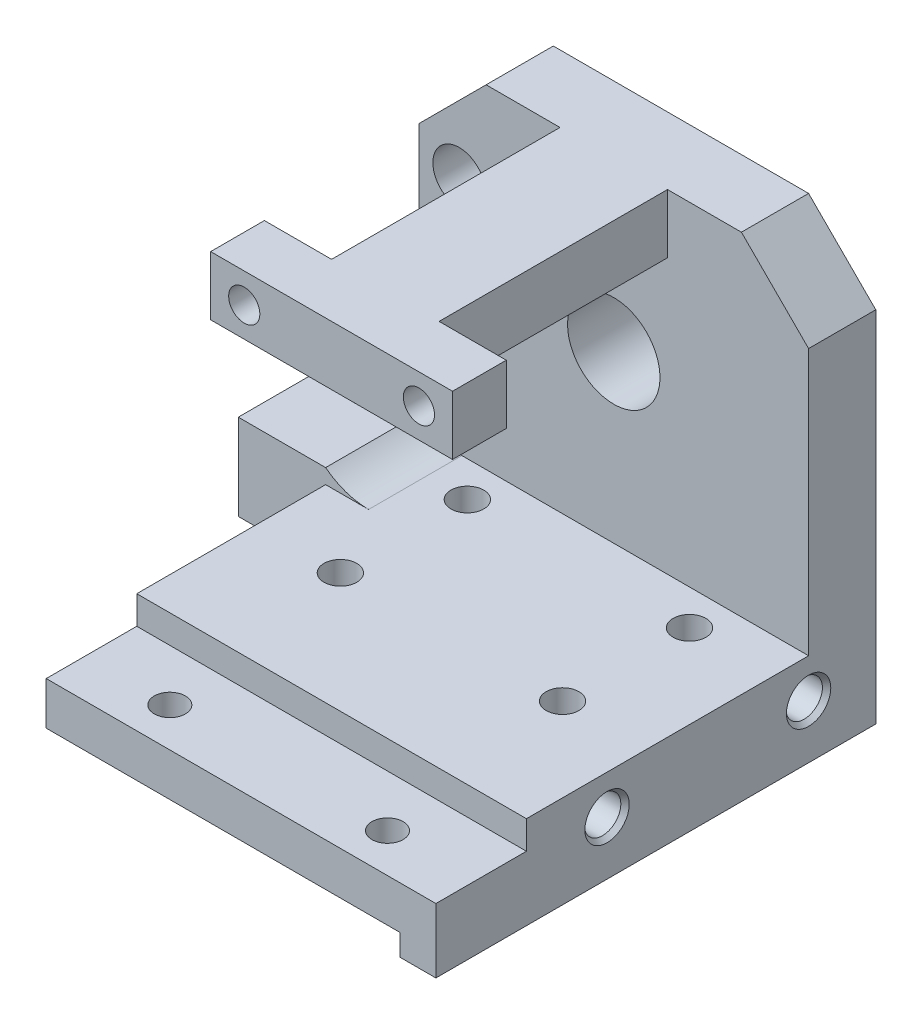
ISO-10303-21;
HEADER;
FILE_DESCRIPTION(('STEP AP214'),'2;1');
FILE_NAME('part.step','',(''),(''),'','','');
FILE_SCHEMA(('AUTOMOTIVE_DESIGN { 1 0 10303 214 1 1 1 1 }'));
ENDSEC;
DATA;
#1=APPLICATION_CONTEXT('core data for automotive mechanical design processes');
#2=APPLICATION_PROTOCOL_DEFINITION('international standard','automotive_design',2000,#1);
#3=PRODUCT_CONTEXT('',#1,'mechanical');
#4=PRODUCT('Part','Part','',(#3));
#5=PRODUCT_RELATED_PRODUCT_CATEGORY('part','',(#4));
#6=PRODUCT_DEFINITION_FORMATION('','',#4);
#7=PRODUCT_DEFINITION_CONTEXT('part definition',#1,'design');
#8=PRODUCT_DEFINITION('design','',#6,#7);
#9=PRODUCT_DEFINITION_SHAPE('','',#8);
#10=(LENGTH_UNIT() NAMED_UNIT(*) SI_UNIT(.MILLI.,.METRE.));
#11=(NAMED_UNIT(*) PLANE_ANGLE_UNIT() SI_UNIT($,.RADIAN.));
#12=(NAMED_UNIT(*) SI_UNIT($,.STERADIAN.) SOLID_ANGLE_UNIT());
#13=UNCERTAINTY_MEASURE_WITH_UNIT(LENGTH_MEASURE(1.E-05),#10,'distance_accuracy_value','');
#14=(GEOMETRIC_REPRESENTATION_CONTEXT(3) GLOBAL_UNCERTAINTY_ASSIGNED_CONTEXT((#13)) GLOBAL_UNIT_ASSIGNED_CONTEXT((#10,
#11,#12)) REPRESENTATION_CONTEXT('',''));
#15=CARTESIAN_POINT('',(0.,0.,0.));
#16=DIRECTION('',(0.,0.,1.));
#17=DIRECTION('',(1.,0.,0.));
#18=AXIS2_PLACEMENT_3D('',#15,#16,#17);
#19=CARTESIAN_POINT('',(-18.415,15.748,6.34999999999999));
#20=DIRECTION('',(0.,0.,1.));
#21=DIRECTION('',(1.,0.,0.));
#22=AXIS2_PLACEMENT_3D('',#19,#20,#21);
#23=PLANE('',#22);
#24=CARTESIAN_POINT('',(0.,0.,6.35));
#25=DIRECTION('',(0.,0.,-1.));
#26=DIRECTION('',(-1.,0.,0.));
#27=AXIS2_PLACEMENT_3D('',#24,#25,#26);
#28=CIRCLE('',#27,4.3688);
#29=CARTESIAN_POINT('',(-4.3688,0.,6.35));
#30=VERTEX_POINT('',#29);
#31=EDGE_CURVE('E346',#30,#30,#28,.T.);
#32=ORIENTED_EDGE('',*,*,#31,.T.);
#33=EDGE_LOOP('',(#32));
#34=FACE_BOUND('',#33,.T.);
#35=CARTESIAN_POINT('',(-14.605,6.85799999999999,6.34999999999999));
#36=DIRECTION('',(0.,0.,-1.));
#37=DIRECTION('',(-1.,0.,0.));
#38=AXIS2_PLACEMENT_3D('',#35,#36,#37);
#39=CIRCLE('',#38,2.48919999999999);
#40=CARTESIAN_POINT('',(-17.0942,6.85799999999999,6.34999999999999));
#41=VERTEX_POINT('',#40);
#42=EDGE_CURVE('E444',#41,#41,#39,.T.);
#43=ORIENTED_EDGE('',*,*,#42,.T.);
#44=EDGE_LOOP('',(#43));
#45=FACE_BOUND('',#44,.T.);
#46=DIRECTION('',(0.,-1.,0.));
#47=VECTOR('',#46,1.);
#48=CARTESIAN_POINT('',(-18.415,15.748,6.34999999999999));
#49=LINE('',#48,#47);
#50=CARTESIAN_POINT('',(-18.415,9.39799999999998,6.35));
#51=VERTEX_POINT('',#50);
#52=CARTESIAN_POINT('',(-18.415,-10.795,6.34999999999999));
#53=VERTEX_POINT('',#52);
#54=EDGE_CURVE('E377',#51,#53,#49,.T.);
#55=ORIENTED_EDGE('',*,*,#54,.T.);
#56=CARTESIAN_POINT('',(-21.971,-10.795,6.34999999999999));
#57=DIRECTION('',(0.,0.,1.));
#58=DIRECTION('',(1.,0.,0.));
#59=AXIS2_PLACEMENT_3D('',#56,#57,#58);
#60=CIRCLE('',#59,3.556);
#61=CARTESIAN_POINT('',(-21.971,-14.351,6.34999999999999));
#62=VERTEX_POINT('',#61);
#63=EDGE_CURVE('E13',#53,#62,#60,.F.);
#64=ORIENTED_EDGE('',*,*,#63,.T.);
#65=DIRECTION('',(-1.,0.,0.));
#66=VECTOR('',#65,1.);
#67=CARTESIAN_POINT('',(-26.67,-14.351,6.34999999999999));
#68=LINE('',#67,#66);
#69=CARTESIAN_POINT('',(-18.415,-14.351,6.35));
#70=VERTEX_POINT('',#69);
#71=EDGE_CURVE('E51',#70,#62,#68,.T.);
#72=ORIENTED_EDGE('',*,*,#71,.F.);
#73=CARTESIAN_POINT('',(-14.3529848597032,-9.14400000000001,6.34999999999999));
#74=DIRECTION('',(0.,0.,1.));
#75=DIRECTION('',(1.,0.,0.));
#76=AXIS2_PLACEMENT_3D('',#73,#74,#75);
#77=CIRCLE('',#76,6.604);
#78=CARTESIAN_POINT('',(-14.3529848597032,-15.748,6.34999999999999));
#79=VERTEX_POINT('',#78);
#80=EDGE_CURVE('E227',#70,#79,#77,.T.);
#81=ORIENTED_EDGE('',*,*,#80,.T.);
#82=DIRECTION('',(-1.,0.,0.));
#83=VECTOR('',#82,1.);
#84=CARTESIAN_POINT('',(-18.415,-15.748,6.35));
#85=LINE('',#84,#83);
#86=CARTESIAN_POINT('',(18.415,-15.748,6.34999999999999));
#87=VERTEX_POINT('',#86);
#88=EDGE_CURVE('E238',#87,#79,#85,.T.);
#89=ORIENTED_EDGE('',*,*,#88,.F.);
#90=DIRECTION('',(0.,1.,0.));
#91=VECTOR('',#90,1.);
#92=CARTESIAN_POINT('',(18.415,15.748,6.34999999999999));
#93=LINE('',#92,#91);
#94=CARTESIAN_POINT('',(18.415,9.39799999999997,6.34999999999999));
#95=VERTEX_POINT('',#94);
#96=EDGE_CURVE('E351',#87,#95,#93,.T.);
#97=ORIENTED_EDGE('',*,*,#96,.T.);
#98=DIRECTION('',(0.707106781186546,-0.707106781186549,0.));
#99=VECTOR('',#98,1.);
#100=CARTESIAN_POINT('',(-3.17499999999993,30.988,6.34999999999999));
#101=LINE('',#100,#99);
#102=CARTESIAN_POINT('',(12.065,15.748,6.34999999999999));
#103=VERTEX_POINT('',#102);
#104=EDGE_CURVE('E477',#95,#103,#101,.F.);
#105=ORIENTED_EDGE('',*,*,#104,.T.);
#106=DIRECTION('',(-1.,0.,0.));
#107=VECTOR('',#106,1.);
#108=CARTESIAN_POINT('',(-18.415,15.748,6.34999999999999));
#109=LINE('',#108,#107);
#110=CARTESIAN_POINT('',(5.08,15.748,6.34999999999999));
#111=VERTEX_POINT('',#110);
#112=EDGE_CURVE('E389',#103,#111,#109,.T.);
#113=ORIENTED_EDGE('',*,*,#112,.T.);
#114=DIRECTION('',(0.,1.,0.));
#115=VECTOR('',#114,1.);
#116=CARTESIAN_POINT('',(5.08,15.748,6.34999999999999));
#117=LINE('',#116,#115);
#118=CARTESIAN_POINT('',(5.08,10.16,6.34999999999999));
#119=VERTEX_POINT('',#118);
#120=EDGE_CURVE('E625',#119,#111,#117,.T.);
#121=ORIENTED_EDGE('',*,*,#120,.F.);
#122=DIRECTION('',(1.,0.,0.));
#123=VECTOR('',#122,1.);
#124=CARTESIAN_POINT('',(-5.08,10.16,6.35));
#125=LINE('',#124,#123);
#126=CARTESIAN_POINT('',(-5.08,10.16,6.35));
#127=VERTEX_POINT('',#126);
#128=EDGE_CURVE('E628',#127,#119,#125,.T.);
#129=ORIENTED_EDGE('',*,*,#128,.F.);
#130=DIRECTION('',(0.,-1.,0.));
#131=VECTOR('',#130,1.);
#132=CARTESIAN_POINT('',(-5.08,15.748,6.34999999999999));
#133=LINE('',#132,#131);
#134=CARTESIAN_POINT('',(-5.08,15.748,6.34999999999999));
#135=VERTEX_POINT('',#134);
#136=EDGE_CURVE('E471',#135,#127,#133,.T.);
#137=ORIENTED_EDGE('',*,*,#136,.F.);
#138=CARTESIAN_POINT('',(-12.065,15.748,6.34999999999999));
#139=VERTEX_POINT('',#138);
#140=EDGE_CURVE('E390',#135,#139,#109,.T.);
#141=ORIENTED_EDGE('',*,*,#140,.T.);
#142=DIRECTION('',(0.707106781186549,0.707106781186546,0.));
#143=VECTOR('',#142,1.);
#144=CARTESIAN_POINT('',(-15.24,12.573,6.34999999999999));
#145=LINE('',#144,#143);
#146=EDGE_CURVE('E376',#139,#51,#145,.F.);
#147=ORIENTED_EDGE('',*,*,#146,.T.);
#148=EDGE_LOOP('',(#55,#64,#72,#81,#89,#97,#105,#113,#121,#129,#137,#141,#147));
#149=FACE_BOUND('',#148,.T.);
#150=ADVANCED_FACE('F37',(#34,#45,#149),#23,.T.);
#151=CARTESIAN_POINT('',(-18.415,-15.748,43.18));
#152=DIRECTION('',(0.,-1.,0.));
#153=DIRECTION('',(0.,0.,-1.));
#154=AXIS2_PLACEMENT_3D('',#151,#152,#153);
#155=PLANE('',#154);
#156=CARTESIAN_POINT('',(10.500000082,-15.748,21.690000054));
#157=DIRECTION('',(0.,1.,0.));
#158=DIRECTION('',(0.,0.,1.));
#159=AXIS2_PLACEMENT_3D('',#156,#157,#158);
#160=CIRCLE('',#159,1.54999999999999);
#161=CARTESIAN_POINT('',(10.500000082,-15.748,23.240000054));
#162=VERTEX_POINT('',#161);
#163=EDGE_CURVE('E296',#162,#162,#160,.T.);
#164=ORIENTED_EDGE('',*,*,#163,.F.);
#165=EDGE_LOOP('',(#164));
#166=FACE_BOUND('',#165,.T.);
#167=CARTESIAN_POINT('',(-10.500000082,-15.748,21.690000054));
#168=DIRECTION('',(0.,1.,0.));
#169=DIRECTION('',(0.,0.,1.));
#170=AXIS2_PLACEMENT_3D('',#167,#168,#169);
#171=CIRCLE('',#170,1.54999999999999);
#172=CARTESIAN_POINT('',(-10.500000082,-15.748,23.240000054));
#173=VERTEX_POINT('',#172);
#174=EDGE_CURVE('E290',#173,#173,#171,.T.);
#175=ORIENTED_EDGE('',*,*,#174,.F.);
#176=EDGE_LOOP('',(#175));
#177=FACE_BOUND('',#176,.T.);
#178=CARTESIAN_POINT('',(-10.500000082,-15.748,9.689999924));
#179=DIRECTION('',(0.,1.,0.));
#180=DIRECTION('',(0.,0.,1.));
#181=AXIS2_PLACEMENT_3D('',#178,#179,#180);
#182=CIRCLE('',#181,1.54999999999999);
#183=CARTESIAN_POINT('',(-10.500000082,-15.748,11.239999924));
#184=VERTEX_POINT('',#183);
#185=EDGE_CURVE('E284',#184,#184,#182,.T.);
#186=ORIENTED_EDGE('',*,*,#185,.F.);
#187=EDGE_LOOP('',(#186));
#188=FACE_BOUND('',#187,.T.);
#189=CARTESIAN_POINT('',(10.500000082,-15.748,9.689999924));
#190=DIRECTION('',(0.,1.,0.));
#191=DIRECTION('',(0.,0.,1.));
#192=AXIS2_PLACEMENT_3D('',#189,#190,#191);
#193=CIRCLE('',#192,1.54999999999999);
#194=CARTESIAN_POINT('',(10.500000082,-15.748,11.239999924));
#195=VERTEX_POINT('',#194);
#196=EDGE_CURVE('E278',#195,#195,#193,.T.);
#197=ORIENTED_EDGE('',*,*,#196,.F.);
#198=EDGE_LOOP('',(#197));
#199=FACE_BOUND('',#198,.T.);
#200=ORIENTED_EDGE('',*,*,#88,.T.);
#201=DIRECTION('',(0.,0.,1.));
#202=VECTOR('',#201,1.);
#203=CARTESIAN_POINT('',(-14.3529848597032,-15.748,43.18));
#204=LINE('',#203,#202);
#205=CARTESIAN_POINT('',(-14.3529848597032,-15.748,15.1678222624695));
#206=VERTEX_POINT('',#205);
#207=EDGE_CURVE('E223',#79,#206,#204,.T.);
#208=ORIENTED_EDGE('',*,*,#207,.T.);
#209=DIRECTION('',(-1.,0.,0.));
#210=VECTOR('',#209,1.);
#211=CARTESIAN_POINT('',(-26.67,-15.748,15.1678222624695));
#212=LINE('',#211,#210);
#213=CARTESIAN_POINT('',(-18.415,-15.748,15.1678222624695));
#214=VERTEX_POINT('',#213);
#215=EDGE_CURVE('E216',#206,#214,#212,.T.);
#216=ORIENTED_EDGE('',*,*,#215,.T.);
#217=DIRECTION('',(0.,0.,-1.));
#218=VECTOR('',#217,1.);
#219=CARTESIAN_POINT('',(-18.415,-15.748,43.18));
#220=LINE('',#219,#218);
#221=CARTESIAN_POINT('',(-18.415,-15.748,33.02));
#222=VERTEX_POINT('',#221);
#223=EDGE_CURVE('E221',#222,#214,#220,.T.);
#224=ORIENTED_EDGE('',*,*,#223,.F.);
#225=DIRECTION('',(-1.,0.,0.));
#226=VECTOR('',#225,1.);
#227=CARTESIAN_POINT('',(18.41505,-15.748,33.02));
#228=LINE('',#227,#226);
#229=CARTESIAN_POINT('',(18.415,-15.748,33.02));
#230=VERTEX_POINT('',#229);
#231=EDGE_CURVE('E334',#230,#222,#228,.T.);
#232=ORIENTED_EDGE('',*,*,#231,.F.);
#233=DIRECTION('',(0.,0.,-1.));
#234=VECTOR('',#233,1.);
#235=CARTESIAN_POINT('',(18.415,-15.748,43.18));
#236=LINE('',#235,#234);
#237=EDGE_CURVE('E237',#230,#87,#236,.T.);
#238=ORIENTED_EDGE('',*,*,#237,.T.);
#239=EDGE_LOOP('',(#200,#208,#216,#224,#232,#238));
#240=FACE_BOUND('',#239,.T.);
#241=ADVANCED_FACE('F219',(#166,#177,#188,#199,#240),#155,.F.);
#242=CARTESIAN_POINT('',(-18.415,15.748,6.34999999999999));
#243=DIRECTION('',(1.,0.,0.));
#244=DIRECTION('',(0.,1.,0.));
#245=AXIS2_PLACEMENT_3D('',#242,#243,#244);
#246=PLANE('',#245);
#247=DIRECTION('',(0.,-1.,0.));
#248=VECTOR('',#247,1.);
#249=CARTESIAN_POINT('',(-18.415,15.748,0.));
#250=LINE('',#249,#248);
#251=CARTESIAN_POINT('',(-18.415,9.39799999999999,0.));
#252=VERTEX_POINT('',#251);
#253=CARTESIAN_POINT('',(-18.415,-10.795,0.));
#254=VERTEX_POINT('',#253);
#255=EDGE_CURVE('E256',#252,#254,#250,.T.);
#256=ORIENTED_EDGE('',*,*,#255,.T.);
#257=DIRECTION('',(0.,0.,-1.));
#258=VECTOR('',#257,1.);
#259=CARTESIAN_POINT('',(-18.415,-10.795,6.34999999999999));
#260=LINE('',#259,#258);
#261=EDGE_CURVE('E428',#254,#53,#260,.F.);
#262=ORIENTED_EDGE('',*,*,#261,.T.);
#263=ORIENTED_EDGE('',*,*,#54,.F.);
#264=DIRECTION('',(0.,0.,-1.));
#265=VECTOR('',#264,1.);
#266=CARTESIAN_POINT('',(-18.415,9.39799999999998,6.35));
#267=LINE('',#266,#265);
#268=EDGE_CURVE('E443',#51,#252,#267,.T.);
#269=ORIENTED_EDGE('',*,*,#268,.T.);
#270=EDGE_LOOP('',(#256,#262,#263,#269));
#271=FACE_BOUND('',#270,.T.);
#272=ADVANCED_FACE('F440',(#271),#246,.F.);
#273=DIRECTION('',(0.,1.,0.));
#274=VECTOR('',#273,1.);
#275=CARTESIAN_POINT('',(-18.415,-15.748,15.1678222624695));
#276=LINE('',#275,#274);
#277=CARTESIAN_POINT('',(-18.415,-22.479,15.1678222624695));
#278=VERTEX_POINT('',#277);
#279=EDGE_CURVE('E232',#278,#214,#276,.T.);
#280=ORIENTED_EDGE('',*,*,#279,.F.);
#281=DIRECTION('',(0.,0.,1.));
#282=VECTOR('',#281,1.);
#283=CARTESIAN_POINT('',(-18.415,-22.479,6.35));
#284=LINE('',#283,#282);
#285=CARTESIAN_POINT('',(-18.415,-22.479,41.5773997));
#286=VERTEX_POINT('',#285);
#287=EDGE_CURVE('E314',#278,#286,#284,.T.);
#288=ORIENTED_EDGE('',*,*,#287,.T.);
#289=DIRECTION('',(0.,-1.,0.));
#290=VECTOR('',#289,1.);
#291=CARTESIAN_POINT('',(-18.415,-18.415,41.5773997));
#292=LINE('',#291,#290);
#293=CARTESIAN_POINT('',(-18.415,-18.415,41.5773997));
#294=VERTEX_POINT('',#293);
#295=EDGE_CURVE('E265',#294,#286,#292,.T.);
#296=ORIENTED_EDGE('',*,*,#295,.F.);
#297=DIRECTION('',(0.,0.,1.));
#298=VECTOR('',#297,1.);
#299=CARTESIAN_POINT('',(-18.415,-18.415,43.18));
#300=LINE('',#299,#298);
#301=CARTESIAN_POINT('',(-18.415,-18.415,33.02));
#302=VERTEX_POINT('',#301);
#303=EDGE_CURVE('E330',#302,#294,#300,.T.);
#304=ORIENTED_EDGE('',*,*,#303,.F.);
#305=DIRECTION('',(0.,-1.,0.));
#306=VECTOR('',#305,1.);
#307=CARTESIAN_POINT('',(-18.415,-15.748,33.02));
#308=LINE('',#307,#306);
#309=EDGE_CURVE('E236',#222,#302,#308,.T.);
#310=ORIENTED_EDGE('',*,*,#309,.F.);
#311=ORIENTED_EDGE('',*,*,#223,.T.);
#312=EDGE_LOOP('',(#280,#288,#296,#304,#310,#311));
#313=FACE_BOUND('',#312,.T.);
#314=ADVANCED_FACE('F231',(#313),#246,.F.);
#315=CARTESIAN_POINT('',(-5.08,15.748,44.6153156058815));
#316=DIRECTION('',(1.,0.,0.));
#317=DIRECTION('',(0.,1.,0.));
#318=AXIS2_PLACEMENT_3D('',#315,#316,#317);
#319=PLANE('',#318);
#320=DIRECTION('',(0.,-1.,0.));
#321=VECTOR('',#320,1.);
#322=CARTESIAN_POINT('',(-5.08,15.748,27.94));
#323=LINE('',#322,#321);
#324=CARTESIAN_POINT('',(-5.08,15.748,27.94));
#325=VERTEX_POINT('',#324);
#326=CARTESIAN_POINT('',(-5.08,10.16,27.94));
#327=VERTEX_POINT('',#326);
#328=EDGE_CURVE('E640',#325,#327,#323,.T.);
#329=ORIENTED_EDGE('',*,*,#328,.F.);
#330=DIRECTION('',(0.,0.,-1.));
#331=VECTOR('',#330,1.);
#332=CARTESIAN_POINT('',(-5.08,15.748,44.6153156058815));
#333=LINE('',#332,#331);
#334=EDGE_CURVE('E623',#325,#135,#333,.T.);
#335=ORIENTED_EDGE('',*,*,#334,.T.);
#336=ORIENTED_EDGE('',*,*,#136,.T.);
#337=DIRECTION('',(0.,0.,-1.));
#338=VECTOR('',#337,1.);
#339=CARTESIAN_POINT('',(-5.08,10.16,44.6153156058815));
#340=LINE('',#339,#338);
#341=EDGE_CURVE('E616',#327,#127,#340,.T.);
#342=ORIENTED_EDGE('',*,*,#341,.F.);
#343=EDGE_LOOP('',(#329,#335,#336,#342));
#344=FACE_BOUND('',#343,.T.);
#345=ADVANCED_FACE('F528',(#344),#319,.F.);
#346=CARTESIAN_POINT('',(-18.415,-22.479,6.35));
#347=DIRECTION('',(0.,1.,0.));
#348=DIRECTION('',(-1.,0.,0.));
#349=AXIS2_PLACEMENT_3D('',#346,#347,#348);
#350=PLANE('',#349);
#351=CARTESIAN_POINT('',(10.500000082,-22.479,9.689999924));
#352=DIRECTION('',(0.,1.,0.));
#353=DIRECTION('',(-1.,0.,0.));
#354=AXIS2_PLACEMENT_3D('',#351,#352,#353);
#355=CIRCLE('',#354,1.54999999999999);
#356=CARTESIAN_POINT('',(8.95000008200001,-22.479,9.689999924));
#357=VERTEX_POINT('',#356);
#358=EDGE_CURVE('E281',#357,#357,#355,.T.);
#359=ORIENTED_EDGE('',*,*,#358,.T.);
#360=EDGE_LOOP('',(#359));
#361=FACE_BOUND('',#360,.T.);
#362=CARTESIAN_POINT('',(-10.500000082,-22.479,9.689999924));
#363=DIRECTION('',(0.,1.,0.));
#364=DIRECTION('',(-1.,0.,0.));
#365=AXIS2_PLACEMENT_3D('',#362,#363,#364);
#366=CIRCLE('',#365,1.54999999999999);
#367=CARTESIAN_POINT('',(-12.050000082,-22.479,9.689999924));
#368=VERTEX_POINT('',#367);
#369=EDGE_CURVE('E287',#368,#368,#366,.T.);
#370=ORIENTED_EDGE('',*,*,#369,.T.);
#371=EDGE_LOOP('',(#370));
#372=FACE_BOUND('',#371,.T.);
#373=CARTESIAN_POINT('',(-10.500000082,-22.479,21.690000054));
#374=DIRECTION('',(0.,1.,0.));
#375=DIRECTION('',(-1.,0.,0.));
#376=AXIS2_PLACEMENT_3D('',#373,#374,#375);
#377=CIRCLE('',#376,1.54999999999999);
#378=CARTESIAN_POINT('',(-12.050000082,-22.479,21.690000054));
#379=VERTEX_POINT('',#378);
#380=EDGE_CURVE('E293',#379,#379,#377,.T.);
#381=ORIENTED_EDGE('',*,*,#380,.T.);
#382=EDGE_LOOP('',(#381));
#383=FACE_BOUND('',#382,.T.);
#384=CARTESIAN_POINT('',(10.500000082,-22.479,21.690000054));
#385=DIRECTION('',(0.,1.,0.));
#386=DIRECTION('',(-1.,0.,0.));
#387=AXIS2_PLACEMENT_3D('',#384,#385,#386);
#388=CIRCLE('',#387,1.54999999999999);
#389=CARTESIAN_POINT('',(8.95000008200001,-22.479,21.690000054));
#390=VERTEX_POINT('',#389);
#391=EDGE_CURVE('E299',#390,#390,#388,.T.);
#392=ORIENTED_EDGE('',*,*,#391,.T.);
#393=EDGE_LOOP('',(#392));
#394=FACE_BOUND('',#393,.T.);
#395=CARTESIAN_POINT('',(10.16,-22.479,37.8943997));
#396=DIRECTION('',(0.,-1.,0.));
#397=DIRECTION('',(0.,0.,-1.));
#398=AXIS2_PLACEMENT_3D('',#395,#396,#397);
#399=CIRCLE('',#398,1.4732);
#400=CARTESIAN_POINT('',(10.16,-22.479,36.4211997));
#401=VERTEX_POINT('',#400);
#402=EDGE_CURVE('E302',#401,#401,#399,.T.);
#403=ORIENTED_EDGE('',*,*,#402,.F.);
#404=EDGE_LOOP('',(#403));
#405=FACE_BOUND('',#404,.T.);
#406=CARTESIAN_POINT('',(-10.414,-22.479,37.8943997));
#407=DIRECTION('',(0.,-1.,0.));
#408=DIRECTION('',(0.,0.,-1.));
#409=AXIS2_PLACEMENT_3D('',#406,#407,#408);
#410=CIRCLE('',#409,1.4732);
#411=CARTESIAN_POINT('',(-10.414,-22.479,36.4211997));
#412=VERTEX_POINT('',#411);
#413=EDGE_CURVE('E306',#412,#412,#410,.T.);
#414=ORIENTED_EDGE('',*,*,#413,.F.);
#415=EDGE_LOOP('',(#414));
#416=FACE_BOUND('',#415,.T.);
#417=DIRECTION('',(0.,0.,1.));
#418=VECTOR('',#417,1.);
#419=CARTESIAN_POINT('',(-26.67,-22.479,0.));
#420=LINE('',#419,#418);
#421=CARTESIAN_POINT('',(-26.67,-22.479,4.318));
#422=VERTEX_POINT('',#421);
#423=CARTESIAN_POINT('',(-26.67,-22.479,15.1678222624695));
#424=VERTEX_POINT('',#423);
#425=EDGE_CURVE('E245',#422,#424,#420,.T.);
#426=ORIENTED_EDGE('',*,*,#425,.F.);
#427=DIRECTION('',(-0.866025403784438,0.,0.500000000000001));
#428=VECTOR('',#427,1.);
#429=CARTESIAN_POINT('',(-26.67,-22.479,4.318));
#430=LINE('',#429,#428);
#431=CARTESIAN_POINT('',(-19.1910046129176,-22.479,0.));
#432=VERTEX_POINT('',#431);
#433=EDGE_CURVE('E402',#422,#432,#430,.F.);
#434=ORIENTED_EDGE('',*,*,#433,.T.);
#435=DIRECTION('',(1.,0.,0.));
#436=VECTOR('',#435,1.);
#437=CARTESIAN_POINT('',(-18.415,-22.479,0.));
#438=LINE('',#437,#436);
#439=CARTESIAN_POINT('',(14.999999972,-22.479,0.));
#440=VERTEX_POINT('',#439);
#441=EDGE_CURVE('E398',#432,#440,#438,.T.);
#442=ORIENTED_EDGE('',*,*,#441,.T.);
#443=DIRECTION('',(0.,0.,-1.));
#444=VECTOR('',#443,1.);
#445=CARTESIAN_POINT('',(14.999999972,-22.479,0.));
#446=LINE('',#445,#444);
#447=CARTESIAN_POINT('',(14.999999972,-22.479,41.5773997));
#448=VERTEX_POINT('',#447);
#449=EDGE_CURVE('E316',#448,#440,#446,.T.);
#450=ORIENTED_EDGE('',*,*,#449,.F.);
#451=DIRECTION('',(-1.,0.,0.));
#452=VECTOR('',#451,1.);
#453=CARTESIAN_POINT('',(-18.415,-22.479,41.5773997));
#454=LINE('',#453,#452);
#455=EDGE_CURVE('E275',#448,#286,#454,.T.);
#456=ORIENTED_EDGE('',*,*,#455,.T.);
#457=ORIENTED_EDGE('',*,*,#287,.F.);
#458=DIRECTION('',(1.,0.,0.));
#459=VECTOR('',#458,1.);
#460=CARTESIAN_POINT('',(-26.67,-22.479,15.1678222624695));
#461=LINE('',#460,#459);
#462=EDGE_CURVE('E244',#424,#278,#461,.T.);
#463=ORIENTED_EDGE('',*,*,#462,.F.);
#464=EDGE_LOOP('',(#426,#434,#442,#450,#456,#457,#463));
#465=FACE_BOUND('',#464,.T.);
#466=ADVANCED_FACE('F519',(#361,#372,#383,#394,#405,#416,#465),#350,.F.);
#467=CARTESIAN_POINT('',(-18.415,15.748,0.));
#468=DIRECTION('',(0.,0.,1.));
#469=DIRECTION('',(1.,0.,0.));
#470=AXIS2_PLACEMENT_3D('',#467,#468,#469);
#471=PLANE('',#470);
#472=ORIENTED_EDGE('',*,*,#441,.F.);
#473=DIRECTION('',(0.,1.,0.));
#474=VECTOR('',#473,1.);
#475=CARTESIAN_POINT('',(-19.1910046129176,15.748,0.));
#476=LINE('',#475,#474);
#477=CARTESIAN_POINT('',(-19.1910046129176,-13.0123772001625,0.));
#478=VERTEX_POINT('',#477);
#479=EDGE_CURVE('E59',#432,#478,#476,.T.);
#480=ORIENTED_EDGE('',*,*,#479,.T.);
#481=CARTESIAN_POINT('',(-21.971,-10.795,0.));
#482=DIRECTION('',(0.,0.,1.));
#483=DIRECTION('',(1.,0.,0.));
#484=AXIS2_PLACEMENT_3D('',#481,#482,#483);
#485=CIRCLE('',#484,3.556);
#486=EDGE_CURVE('E45',#478,#254,#485,.T.);
#487=ORIENTED_EDGE('',*,*,#486,.T.);
#488=ORIENTED_EDGE('',*,*,#255,.F.);
#489=DIRECTION('',(-0.707106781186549,-0.707106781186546,0.));
#490=VECTOR('',#489,1.);
#491=CARTESIAN_POINT('',(-18.415,9.39799999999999,0.));
#492=LINE('',#491,#490);
#493=CARTESIAN_POINT('',(-12.065,15.748,0.));
#494=VERTEX_POINT('',#493);
#495=EDGE_CURVE('E370',#252,#494,#492,.F.);
#496=ORIENTED_EDGE('',*,*,#495,.T.);
#497=DIRECTION('',(-1.,0.,0.));
#498=VECTOR('',#497,1.);
#499=CARTESIAN_POINT('',(-18.415,15.748,0.));
#500=LINE('',#499,#498);
#501=CARTESIAN_POINT('',(12.065,15.748,0.));
#502=VERTEX_POINT('',#501);
#503=EDGE_CURVE('E381',#502,#494,#500,.T.);
#504=ORIENTED_EDGE('',*,*,#503,.F.);
#505=DIRECTION('',(-0.707106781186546,0.707106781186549,0.));
#506=VECTOR('',#505,1.);
#507=CARTESIAN_POINT('',(12.065,15.748,0.));
#508=LINE('',#507,#506);
#509=CARTESIAN_POINT('',(18.415,9.39799999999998,0.));
#510=VERTEX_POINT('',#509);
#511=EDGE_CURVE('E372',#502,#510,#508,.F.);
#512=ORIENTED_EDGE('',*,*,#511,.T.);
#513=DIRECTION('',(0.,1.,0.));
#514=VECTOR('',#513,1.);
#515=CARTESIAN_POINT('',(18.415,15.748,0.));
#516=LINE('',#515,#514);
#517=CARTESIAN_POINT('',(18.415,-24.511,0.));
#518=VERTEX_POINT('',#517);
#519=EDGE_CURVE('E395',#518,#510,#516,.T.);
#520=ORIENTED_EDGE('',*,*,#519,.F.);
#521=DIRECTION('',(1.,0.,0.));
#522=VECTOR('',#521,1.);
#523=CARTESIAN_POINT('',(18.415,-24.511,0.));
#524=LINE('',#523,#522);
#525=CARTESIAN_POINT('',(14.999999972,-24.511,0.));
#526=VERTEX_POINT('',#525);
#527=EDGE_CURVE('E327',#526,#518,#524,.T.);
#528=ORIENTED_EDGE('',*,*,#527,.F.);
#529=DIRECTION('',(0.,1.,0.));
#530=VECTOR('',#529,1.);
#531=CARTESIAN_POINT('',(14.999999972,-24.511,0.));
#532=LINE('',#531,#530);
#533=EDGE_CURVE('E331',#526,#440,#532,.T.);
#534=ORIENTED_EDGE('',*,*,#533,.T.);
#535=EDGE_LOOP('',(#472,#480,#487,#488,#496,#504,#512,#520,#528,#534));
#536=FACE_BOUND('',#535,.T.);
#537=CARTESIAN_POINT('',(-14.605,6.858,0.));
#538=DIRECTION('',(0.,0.,-1.));
#539=DIRECTION('',(-1.,0.,0.));
#540=AXIS2_PLACEMENT_3D('',#537,#538,#539);
#541=CIRCLE('',#540,2.48919999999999);
#542=CARTESIAN_POINT('',(-17.0942,6.858,0.));
#543=VERTEX_POINT('',#542);
#544=EDGE_CURVE('E385',#543,#543,#541,.T.);
#545=ORIENTED_EDGE('',*,*,#544,.F.);
#546=EDGE_LOOP('',(#545));
#547=FACE_BOUND('',#546,.T.);
#548=CARTESIAN_POINT('',(1.96850000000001,-3.06439873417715,0.));
#549=DIRECTION('',(0.,0.,1.));
#550=DIRECTION('',(1.,0.,0.));
#551=AXIS2_PLACEMENT_3D('',#548,#549,#550);
#552=CIRCLE('',#551,10.795);
#553=CARTESIAN_POINT('',(12.7635,-3.06439873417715,0.));
#554=VERTEX_POINT('',#553);
#555=EDGE_CURVE('E367',#554,#554,#552,.F.);
#556=ORIENTED_EDGE('',*,*,#555,.F.);
#557=EDGE_LOOP('',(#556));
#558=FACE_BOUND('',#557,.T.);
#559=ADVANCED_FACE('F434',(#536,#547,#558),#471,.F.);
#560=CARTESIAN_POINT('',(18.415,15.748,6.34999999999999));
#561=DIRECTION('',(-1.,0.,0.));
#562=DIRECTION('',(0.,-1.,0.));
#563=AXIS2_PLACEMENT_3D('',#560,#561,#562);
#564=PLANE('',#563);
#565=CARTESIAN_POINT('',(18.415,-19.431,6.34999999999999));
#566=DIRECTION('',(1.,0.,0.));
#567=DIRECTION('',(0.,0.,-1.));
#568=AXIS2_PLACEMENT_3D('',#565,#566,#567);
#569=CIRCLE('',#568,2.0955);
#570=CARTESIAN_POINT('',(18.415,-19.431,4.25449999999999));
#571=VERTEX_POINT('',#570);
#572=EDGE_CURVE('E776',#571,#571,#569,.T.);
#573=ORIENTED_EDGE('',*,*,#572,.F.);
#574=EDGE_LOOP('',(#573));
#575=FACE_BOUND('',#574,.T.);
#576=CARTESIAN_POINT('',(18.415,-19.431,25.4));
#577=DIRECTION('',(1.,0.,0.));
#578=DIRECTION('',(0.,0.,-1.));
#579=AXIS2_PLACEMENT_3D('',#576,#577,#578);
#580=CIRCLE('',#579,2.0955);
#581=CARTESIAN_POINT('',(18.415,-19.431,23.3045));
#582=VERTEX_POINT('',#581);
#583=EDGE_CURVE('E411',#582,#582,#580,.T.);
#584=ORIENTED_EDGE('',*,*,#583,.F.);
#585=EDGE_LOOP('',(#584));
#586=FACE_BOUND('',#585,.T.);
#587=DIRECTION('',(0.,0.,1.));
#588=VECTOR('',#587,1.);
#589=CARTESIAN_POINT('',(18.415,-18.415,6.34999999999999));
#590=LINE('',#589,#588);
#591=CARTESIAN_POINT('',(18.415,-18.415,33.02));
#592=VERTEX_POINT('',#591);
#593=CARTESIAN_POINT('',(18.415,-18.415,41.5773997));
#594=VERTEX_POINT('',#593);
#595=EDGE_CURVE('E337',#592,#594,#590,.T.);
#596=ORIENTED_EDGE('',*,*,#595,.T.);
#597=DIRECTION('',(0.,1.,0.));
#598=VECTOR('',#597,1.);
#599=CARTESIAN_POINT('',(18.415,-18.415,41.5773997));
#600=LINE('',#599,#598);
#601=CARTESIAN_POINT('',(18.415,-24.511,41.5773997));
#602=VERTEX_POINT('',#601);
#603=EDGE_CURVE('E271',#602,#594,#600,.T.);
#604=ORIENTED_EDGE('',*,*,#603,.F.);
#605=DIRECTION('',(0.,0.,1.));
#606=VECTOR('',#605,1.);
#607=CARTESIAN_POINT('',(18.415,-24.511,0.));
#608=LINE('',#607,#606);
#609=EDGE_CURVE('E320',#518,#602,#608,.T.);
#610=ORIENTED_EDGE('',*,*,#609,.F.);
#611=ORIENTED_EDGE('',*,*,#519,.T.);
#612=DIRECTION('',(0.,0.,1.));
#613=VECTOR('',#612,1.);
#614=CARTESIAN_POINT('',(18.415,9.39799999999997,6.34999999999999));
#615=LINE('',#614,#613);
#616=EDGE_CURVE('E374',#510,#95,#615,.T.);
#617=ORIENTED_EDGE('',*,*,#616,.T.);
#618=ORIENTED_EDGE('',*,*,#96,.F.);
#619=ORIENTED_EDGE('',*,*,#237,.F.);
#620=DIRECTION('',(0.,-1.,0.));
#621=VECTOR('',#620,1.);
#622=CARTESIAN_POINT('',(18.415,15.748,33.02));
#623=LINE('',#622,#621);
#624=EDGE_CURVE('E341',#230,#592,#623,.T.);
#625=ORIENTED_EDGE('',*,*,#624,.T.);
#626=EDGE_LOOP('',(#596,#604,#610,#611,#617,#618,#619,#625));
#627=FACE_BOUND('',#626,.T.);
#628=ADVANCED_FACE('F461',(#575,#586,#627),#564,.F.);
#629=CARTESIAN_POINT('',(-18.415,15.748,6.34999999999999));
#630=DIRECTION('',(0.,-1.,0.));
#631=DIRECTION('',(1.,0.,0.));
#632=AXIS2_PLACEMENT_3D('',#629,#630,#631);
#633=PLANE('',#632);
#634=ORIENTED_EDGE('',*,*,#112,.F.);
#635=DIRECTION('',(0.,0.,-1.));
#636=VECTOR('',#635,1.);
#637=CARTESIAN_POINT('',(12.065,15.748,6.34999999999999));
#638=LINE('',#637,#636);
#639=EDGE_CURVE('E366',#103,#502,#638,.T.);
#640=ORIENTED_EDGE('',*,*,#639,.T.);
#641=ORIENTED_EDGE('',*,*,#503,.T.);
#642=DIRECTION('',(0.,0.,1.));
#643=VECTOR('',#642,1.);
#644=CARTESIAN_POINT('',(-12.065,15.748,6.34999999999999));
#645=LINE('',#644,#643);
#646=EDGE_CURVE('E364',#494,#139,#645,.T.);
#647=ORIENTED_EDGE('',*,*,#646,.T.);
#648=ORIENTED_EDGE('',*,*,#140,.F.);
#649=ORIENTED_EDGE('',*,*,#334,.F.);
#650=DIRECTION('',(1.,0.,0.));
#651=VECTOR('',#650,1.);
#652=CARTESIAN_POINT('',(-11.43,15.748,27.94));
#653=LINE('',#652,#651);
#654=CARTESIAN_POINT('',(-11.43,15.748,27.94));
#655=VERTEX_POINT('',#654);
#656=EDGE_CURVE('E632',#655,#325,#653,.T.);
#657=ORIENTED_EDGE('',*,*,#656,.F.);
#658=DIRECTION('',(0.,0.,-1.));
#659=VECTOR('',#658,1.);
#660=CARTESIAN_POINT('',(-11.43,15.748,33.02));
#661=LINE('',#660,#659);
#662=CARTESIAN_POINT('',(-11.43,15.748,33.02));
#663=VERTEX_POINT('',#662);
#664=EDGE_CURVE('E649',#663,#655,#661,.T.);
#665=ORIENTED_EDGE('',*,*,#664,.F.);
#666=DIRECTION('',(1.,0.,0.));
#667=VECTOR('',#666,1.);
#668=CARTESIAN_POINT('',(-5.08,15.748,33.02));
#669=LINE('',#668,#667);
#670=CARTESIAN_POINT('',(11.43,15.748,33.02));
#671=VERTEX_POINT('',#670);
#672=EDGE_CURVE('E614',#663,#671,#669,.T.);
#673=ORIENTED_EDGE('',*,*,#672,.T.);
#674=DIRECTION('',(0.,0.,-1.));
#675=VECTOR('',#674,1.);
#676=CARTESIAN_POINT('',(11.43,15.748,33.02));
#677=LINE('',#676,#675);
#678=CARTESIAN_POINT('',(11.43,15.748,27.94));
#679=VERTEX_POINT('',#678);
#680=EDGE_CURVE('E658',#671,#679,#677,.T.);
#681=ORIENTED_EDGE('',*,*,#680,.T.);
#682=DIRECTION('',(-1.,0.,0.));
#683=VECTOR('',#682,1.);
#684=CARTESIAN_POINT('',(11.43,15.748,27.94));
#685=LINE('',#684,#683);
#686=CARTESIAN_POINT('',(5.08,15.748,27.94));
#687=VERTEX_POINT('',#686);
#688=EDGE_CURVE('E655',#679,#687,#685,.T.);
#689=ORIENTED_EDGE('',*,*,#688,.T.);
#690=DIRECTION('',(0.,0.,-1.));
#691=VECTOR('',#690,1.);
#692=CARTESIAN_POINT('',(5.08,15.748,44.6153156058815));
#693=LINE('',#692,#691);
#694=EDGE_CURVE('E620',#687,#111,#693,.T.);
#695=ORIENTED_EDGE('',*,*,#694,.T.);
#696=EDGE_LOOP('',(#634,#640,#641,#647,#648,#649,#657,#665,#673,#681,#689,#695));
#697=FACE_BOUND('',#696,.T.);
#698=ADVANCED_FACE('F520',(#697),#633,.F.);
#699=CARTESIAN_POINT('',(-14.605,6.85799999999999,6.34999999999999));
#700=DIRECTION('',(0.,0.,-1.));
#701=DIRECTION('',(-1.,0.,0.));
#702=AXIS2_PLACEMENT_3D('',#699,#700,#701);
#703=CYLINDRICAL_SURFACE('',#702,2.48919999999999);
#704=ORIENTED_EDGE('',*,*,#42,.F.);
#705=EDGE_LOOP('',(#704));
#706=FACE_BOUND('',#705,.T.);
#707=ORIENTED_EDGE('',*,*,#544,.T.);
#708=EDGE_LOOP('',(#707));
#709=FACE_BOUND('',#708,.T.);
#710=ADVANCED_FACE('F515',(#706,#709),#703,.F.);
#711=CARTESIAN_POINT('',(1.96850000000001,-3.06439873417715,-1.524));
#712=DIRECTION('',(0.,0.,1.));
#713=DIRECTION('',(1.,0.,0.));
#714=AXIS2_PLACEMENT_3D('',#711,#712,#713);
#715=CYLINDRICAL_SURFACE('',#714,10.795);
#716=CARTESIAN_POINT('',(1.96850000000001,-3.06439873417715,-1.524));
#717=DIRECTION('',(0.,0.,-1.));
#718=DIRECTION('',(-1.,0.,0.));
#719=AXIS2_PLACEMENT_3D('',#716,#717,#718);
#720=CIRCLE('',#719,10.795);
#721=CARTESIAN_POINT('',(12.7635,-3.06439873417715,-1.524));
#722=VERTEX_POINT('',#721);
#723=EDGE_CURVE('E754',#722,#722,#720,.T.);
#724=CARTESIAN_POINT('',(12.7635,-3.06439873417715,-1.524));
#725=CARTESIAN_POINT('',(12.7635,-3.06439873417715,-1.508125));
#726=CARTESIAN_POINT('',(12.7635,-3.06439873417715,-1.49225));
#727=CARTESIAN_POINT('',(12.7635,-3.06439873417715,-1.4605));
#728=CARTESIAN_POINT('',(12.7635,-3.06439873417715,-1.444625));
#729=CARTESIAN_POINT('',(12.7635,-3.06439873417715,-1.412875));
#730=CARTESIAN_POINT('',(12.7635,-3.06439873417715,-1.397));
#731=CARTESIAN_POINT('',(12.7635,-3.06439873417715,-1.36525));
#732=CARTESIAN_POINT('',(12.7635,-3.06439873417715,-1.349375));
#733=CARTESIAN_POINT('',(12.7635,-3.06439873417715,-1.317625));
#734=CARTESIAN_POINT('',(12.7635,-3.06439873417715,-1.30175));
#735=CARTESIAN_POINT('',(12.7635,-3.06439873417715,-1.27));
#736=CARTESIAN_POINT('',(12.7635,-3.06439873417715,-1.254125));
#737=CARTESIAN_POINT('',(12.7635,-3.06439873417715,-1.222375));
#738=CARTESIAN_POINT('',(12.7635,-3.06439873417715,-1.2065));
#739=CARTESIAN_POINT('',(12.7635,-3.06439873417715,-1.17475));
#740=CARTESIAN_POINT('',(12.7635,-3.06439873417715,-1.158875));
#741=CARTESIAN_POINT('',(12.7635,-3.06439873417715,-1.127125));
#742=CARTESIAN_POINT('',(12.7635,-3.06439873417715,-1.11125));
#743=CARTESIAN_POINT('',(12.7635,-3.06439873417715,-1.0795));
#744=CARTESIAN_POINT('',(12.7635,-3.06439873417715,-1.063625));
#745=CARTESIAN_POINT('',(12.7635,-3.06439873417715,-1.031875));
#746=CARTESIAN_POINT('',(12.7635,-3.06439873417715,-1.016));
#747=CARTESIAN_POINT('',(12.7635,-3.06439873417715,-0.984249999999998));
#748=CARTESIAN_POINT('',(12.7635,-3.06439873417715,-0.968374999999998));
#749=CARTESIAN_POINT('',(12.7635,-3.06439873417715,-0.936624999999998));
#750=CARTESIAN_POINT('',(12.7635,-3.06439873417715,-0.920749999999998));
#751=CARTESIAN_POINT('',(12.7635,-3.06439873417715,-0.888999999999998));
#752=CARTESIAN_POINT('',(12.7635,-3.06439873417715,-0.873124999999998));
#753=CARTESIAN_POINT('',(12.7635,-3.06439873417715,-0.841374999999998));
#754=CARTESIAN_POINT('',(12.7635,-3.06439873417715,-0.825499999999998));
#755=CARTESIAN_POINT('',(12.7635,-3.06439873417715,-0.793749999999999));
#756=CARTESIAN_POINT('',(12.7635,-3.06439873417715,-0.777874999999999));
#757=CARTESIAN_POINT('',(12.7635,-3.06439873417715,-0.746124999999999));
#758=CARTESIAN_POINT('',(12.7635,-3.06439873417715,-0.730249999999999));
#759=CARTESIAN_POINT('',(12.7635,-3.06439873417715,-0.698499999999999));
#760=CARTESIAN_POINT('',(12.7635,-3.06439873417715,-0.682624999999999));
#761=CARTESIAN_POINT('',(12.7635,-3.06439873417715,-0.650874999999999));
#762=CARTESIAN_POINT('',(12.7635,-3.06439873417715,-0.634999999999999));
#763=CARTESIAN_POINT('',(12.7635,-3.06439873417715,-0.603249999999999));
#764=CARTESIAN_POINT('',(12.7635,-3.06439873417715,-0.587374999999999));
#765=CARTESIAN_POINT('',(12.7635,-3.06439873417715,-0.555624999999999));
#766=CARTESIAN_POINT('',(12.7635,-3.06439873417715,-0.539749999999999));
#767=CARTESIAN_POINT('',(12.7635,-3.06439873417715,-0.507999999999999));
#768=CARTESIAN_POINT('',(12.7635,-3.06439873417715,-0.492124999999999));
#769=CARTESIAN_POINT('',(12.7635,-3.06439873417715,-0.460374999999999));
#770=CARTESIAN_POINT('',(12.7635,-3.06439873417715,-0.444499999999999));
#771=CARTESIAN_POINT('',(12.7635,-3.06439873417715,-0.412749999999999));
#772=CARTESIAN_POINT('',(12.7635,-3.06439873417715,-0.396874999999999));
#773=CARTESIAN_POINT('',(12.7635,-3.06439873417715,-0.365124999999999));
#774=CARTESIAN_POINT('',(12.7635,-3.06439873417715,-0.349249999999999));
#775=CARTESIAN_POINT('',(12.7635,-3.06439873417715,-0.317499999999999));
#776=CARTESIAN_POINT('',(12.7635,-3.06439873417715,-0.301624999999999));
#777=CARTESIAN_POINT('',(12.7635,-3.06439873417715,-0.269874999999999));
#778=CARTESIAN_POINT('',(12.7635,-3.06439873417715,-0.253999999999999));
#779=CARTESIAN_POINT('',(12.7635,-3.06439873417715,-0.222249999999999));
#780=CARTESIAN_POINT('',(12.7635,-3.06439873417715,-0.206374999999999));
#781=CARTESIAN_POINT('',(12.7635,-3.06439873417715,-0.174625));
#782=CARTESIAN_POINT('',(12.7635,-3.06439873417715,-0.15875));
#783=CARTESIAN_POINT('',(12.7635,-3.06439873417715,-0.127));
#784=CARTESIAN_POINT('',(12.7635,-3.06439873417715,-0.111125));
#785=CARTESIAN_POINT('',(12.7635,-3.06439873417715,-0.0793749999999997));
#786=CARTESIAN_POINT('',(12.7635,-3.06439873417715,-0.0634999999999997));
#787=CARTESIAN_POINT('',(12.7635,-3.06439873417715,-0.0317499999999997));
#788=CARTESIAN_POINT('',(12.7635,-3.06439873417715,-0.0158749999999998));
#789=CARTESIAN_POINT('',(12.7635,-3.06439873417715,0.));
#790=B_SPLINE_CURVE_WITH_KNOTS('',3,(#724,#725,#726,#727,#728,#729,#730,#731,#732,#733,#734,
#735,#736,#737,#738,#739,#740,#741,#742,#743,#744,#745,#746,#747,#748,#749,#750,#751,#752,#753,
#754,#755,#756,#757,#758,#759,#760,#761,#762,#763,#764,#765,#766,#767,#768,#769,#770,#771,#772,
#773,#774,#775,#776,#777,#778,#779,#780,#781,#782,#783,#784,#785,#786,#787,#788,#789),
.UNSPECIFIED.,.F.,.F.,(4,2,2,2,2,2,2,2,2,2,2,2,2,2,2,2,2,2,2,2,2,2,2,2,2,2,2,2,2,2,2,2,4),(0.,
0.0476250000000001,0.0952500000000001,0.142875,0.1905,0.238125,0.28575,0.333375,0.381,0.428625,
0.476249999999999,0.523874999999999,0.571499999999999,0.619124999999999,0.666749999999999,
0.714374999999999,0.761999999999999,0.809624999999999,0.857249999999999,0.904874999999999,
0.952499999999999,1.000125,1.04775,1.095375,1.143,1.190625,1.23825,1.285875,1.3335,1.381125,
1.42875,1.476375,1.524),.UNSPECIFIED.);
#791=EDGE_CURVE('BSEAM743',#722,#554,#790,.T.);
#792=ORIENTED_EDGE('',*,*,#723,.F.);
#793=ORIENTED_EDGE('',*,*,#555,.T.);
#794=ORIENTED_EDGE('',*,*,#791,.T.);
#795=ORIENTED_EDGE('',*,*,#791,.F.);
#796=EDGE_LOOP('',(#792,#794,#793,#795));
#797=FACE_BOUND('',#796,.T.);
#798=ADVANCED_FACE('F743',(#797),#715,.T.);
#799=CARTESIAN_POINT('',(1.96850000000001,-3.06439873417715,-1.524));
#800=DIRECTION('',(0.,0.,-1.));
#801=DIRECTION('',(-1.,0.,0.));
#802=AXIS2_PLACEMENT_3D('',#799,#800,#801);
#803=PLANE('',#802);
#804=CARTESIAN_POINT('',(0.,0.,-1.524));
#805=DIRECTION('',(0.,0.,-1.));
#806=DIRECTION('',(-1.,0.,0.));
#807=AXIS2_PLACEMENT_3D('',#804,#805,#806);
#808=CIRCLE('',#807,4.3688);
#809=CARTESIAN_POINT('',(-4.3688,0.,-1.524));
#810=VERTEX_POINT('',#809);
#811=EDGE_CURVE('E359',#810,#810,#808,.T.);
#812=ORIENTED_EDGE('',*,*,#811,.F.);
#813=EDGE_LOOP('',(#812));
#814=FACE_BOUND('',#813,.T.);
#815=ORIENTED_EDGE('',*,*,#723,.T.);
#816=EDGE_LOOP('',(#815));
#817=FACE_BOUND('',#816,.T.);
#818=ADVANCED_FACE('F740',(#814,#817),#803,.T.);
#819=CARTESIAN_POINT('',(0.,0.,6.35));
#820=DIRECTION('',(0.,0.,-1.));
#821=DIRECTION('',(-1.,0.,0.));
#822=AXIS2_PLACEMENT_3D('',#819,#820,#821);
#823=CYLINDRICAL_SURFACE('',#822,4.3688);
#824=ORIENTED_EDGE('',*,*,#31,.F.);
#825=EDGE_LOOP('',(#824));
#826=FACE_BOUND('',#825,.T.);
#827=ORIENTED_EDGE('',*,*,#811,.T.);
#828=EDGE_LOOP('',(#827));
#829=FACE_BOUND('',#828,.T.);
#830=ADVANCED_FACE('F735',(#826,#829),#823,.F.);
#831=CARTESIAN_POINT('',(18.41505,-15.748,33.02));
#832=DIRECTION('',(0.,0.,-1.));
#833=DIRECTION('',(-1.,0.,0.));
#834=AXIS2_PLACEMENT_3D('',#831,#832,#833);
#835=PLANE('',#834);
#836=ORIENTED_EDGE('',*,*,#231,.T.);
#837=ORIENTED_EDGE('',*,*,#309,.T.);
#838=DIRECTION('',(-1.,0.,0.));
#839=VECTOR('',#838,1.);
#840=CARTESIAN_POINT('',(18.41505,-18.415,33.02));
#841=LINE('',#840,#839);
#842=EDGE_CURVE('E335',#592,#302,#841,.T.);
#843=ORIENTED_EDGE('',*,*,#842,.F.);
#844=ORIENTED_EDGE('',*,*,#624,.F.);
#845=EDGE_LOOP('',(#836,#837,#843,#844));
#846=FACE_BOUND('',#845,.T.);
#847=ADVANCED_FACE('F733',(#846),#835,.F.);
#848=CARTESIAN_POINT('',(18.41505,-18.415,43.18));
#849=DIRECTION('',(0.,-1.,0.));
#850=DIRECTION('',(0.,0.,-1.));
#851=AXIS2_PLACEMENT_3D('',#848,#849,#850);
#852=PLANE('',#851);
#853=CARTESIAN_POINT('',(10.16,-18.415,37.8943997));
#854=DIRECTION('',(0.,-1.,0.));
#855=DIRECTION('',(0.,0.,-1.));
#856=AXIS2_PLACEMENT_3D('',#853,#854,#855);
#857=CIRCLE('',#856,1.47319999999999);
#858=CARTESIAN_POINT('',(10.16,-18.415,36.4211997));
#859=VERTEX_POINT('',#858);
#860=EDGE_CURVE('E305',#859,#859,#857,.T.);
#861=ORIENTED_EDGE('',*,*,#860,.T.);
#862=EDGE_LOOP('',(#861));
#863=FACE_BOUND('',#862,.T.);
#864=CARTESIAN_POINT('',(-10.414,-18.415,37.8943997));
#865=DIRECTION('',(0.,-1.,0.));
#866=DIRECTION('',(0.,0.,-1.));
#867=AXIS2_PLACEMENT_3D('',#864,#865,#866);
#868=CIRCLE('',#867,1.47319999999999);
#869=CARTESIAN_POINT('',(-10.414,-18.415,36.4211997));
#870=VERTEX_POINT('',#869);
#871=EDGE_CURVE('E309',#870,#870,#868,.T.);
#872=ORIENTED_EDGE('',*,*,#871,.T.);
#873=EDGE_LOOP('',(#872));
#874=FACE_BOUND('',#873,.T.);
#875=ORIENTED_EDGE('',*,*,#303,.T.);
#876=DIRECTION('',(-1.,0.,0.));
#877=VECTOR('',#876,1.);
#878=CARTESIAN_POINT('',(-18.415,-18.415,41.5773997));
#879=LINE('',#878,#877);
#880=EDGE_CURVE('E269',#594,#294,#879,.T.);
#881=ORIENTED_EDGE('',*,*,#880,.F.);
#882=ORIENTED_EDGE('',*,*,#595,.F.);
#883=ORIENTED_EDGE('',*,*,#842,.T.);
#884=EDGE_LOOP('',(#875,#881,#882,#883));
#885=FACE_BOUND('',#884,.T.);
#886=ADVANCED_FACE('F485',(#863,#874,#885),#852,.F.);
#887=CARTESIAN_POINT('',(14.999999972,-24.511,0.));
#888=DIRECTION('',(1.,0.,0.));
#889=DIRECTION('',(0.,0.,-1.));
#890=AXIS2_PLACEMENT_3D('',#887,#888,#889);
#891=PLANE('',#890);
#892=DIRECTION('',(0.,0.,-1.));
#893=VECTOR('',#892,1.);
#894=CARTESIAN_POINT('',(14.999999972,-24.511,0.));
#895=LINE('',#894,#893);
#896=CARTESIAN_POINT('',(14.999999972,-24.511,41.5773997));
#897=VERTEX_POINT('',#896);
#898=EDGE_CURVE('E611',#897,#526,#895,.T.);
#899=ORIENTED_EDGE('',*,*,#898,.F.);
#900=DIRECTION('',(0.,1.,0.));
#901=VECTOR('',#900,1.);
#902=CARTESIAN_POINT('',(14.999999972,-24.511,41.5773997));
#903=LINE('',#902,#901);
#904=EDGE_CURVE('E268',#897,#448,#903,.T.);
#905=ORIENTED_EDGE('',*,*,#904,.T.);
#906=ORIENTED_EDGE('',*,*,#449,.T.);
#907=ORIENTED_EDGE('',*,*,#533,.F.);
#908=EDGE_LOOP('',(#899,#905,#906,#907));
#909=FACE_BOUND('',#908,.T.);
#910=ADVANCED_FACE('F727',(#909),#891,.F.);
#911=CARTESIAN_POINT('',(18.415,-24.511,43.18));
#912=DIRECTION('',(0.,-1.,0.));
#913=DIRECTION('',(0.,0.,-1.));
#914=AXIS2_PLACEMENT_3D('',#911,#912,#913);
#915=PLANE('',#914);
#916=DIRECTION('',(1.,0.,0.));
#917=VECTOR('',#916,1.);
#918=CARTESIAN_POINT('',(18.415,-24.511,41.5773997));
#919=LINE('',#918,#917);
#920=EDGE_CURVE('E322',#897,#602,#919,.T.);
#921=ORIENTED_EDGE('',*,*,#920,.F.);
#922=ORIENTED_EDGE('',*,*,#898,.T.);
#923=ORIENTED_EDGE('',*,*,#527,.T.);
#924=ORIENTED_EDGE('',*,*,#609,.T.);
#925=EDGE_LOOP('',(#921,#922,#923,#924));
#926=FACE_BOUND('',#925,.T.);
#927=ADVANCED_FACE('F609',(#926),#915,.T.);
#928=CARTESIAN_POINT('',(5.08,15.748,44.6153156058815));
#929=DIRECTION('',(-1.,0.,0.));
#930=DIRECTION('',(0.,0.,1.));
#931=AXIS2_PLACEMENT_3D('',#928,#929,#930);
#932=PLANE('',#931);
#933=ORIENTED_EDGE('',*,*,#694,.F.);
#934=DIRECTION('',(0.,-1.,0.));
#935=VECTOR('',#934,1.);
#936=CARTESIAN_POINT('',(5.08,15.748,27.94));
#937=LINE('',#936,#935);
#938=CARTESIAN_POINT('',(5.08,10.16,27.94));
#939=VERTEX_POINT('',#938);
#940=EDGE_CURVE('E659',#687,#939,#937,.T.);
#941=ORIENTED_EDGE('',*,*,#940,.T.);
#942=DIRECTION('',(0.,0.,-1.));
#943=VECTOR('',#942,1.);
#944=CARTESIAN_POINT('',(5.08,10.16,44.6153156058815));
#945=LINE('',#944,#943);
#946=EDGE_CURVE('E618',#939,#119,#945,.T.);
#947=ORIENTED_EDGE('',*,*,#946,.T.);
#948=ORIENTED_EDGE('',*,*,#120,.T.);
#949=EDGE_LOOP('',(#933,#941,#947,#948));
#950=FACE_BOUND('',#949,.T.);
#951=ADVANCED_FACE('F696',(#950),#932,.F.);
#952=CARTESIAN_POINT('',(-5.08,10.16,44.6153156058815));
#953=DIRECTION('',(0.,1.,0.));
#954=DIRECTION('',(-1.,0.,0.));
#955=AXIS2_PLACEMENT_3D('',#952,#953,#954);
#956=PLANE('',#955);
#957=ORIENTED_EDGE('',*,*,#946,.F.);
#958=DIRECTION('',(-1.,0.,0.));
#959=VECTOR('',#958,1.);
#960=CARTESIAN_POINT('',(11.43,10.16,27.94));
#961=LINE('',#960,#959);
#962=CARTESIAN_POINT('',(11.43,10.16,27.94));
#963=VERTEX_POINT('',#962);
#964=EDGE_CURVE('E644',#963,#939,#961,.T.);
#965=ORIENTED_EDGE('',*,*,#964,.F.);
#966=DIRECTION('',(0.,0.,1.));
#967=VECTOR('',#966,1.);
#968=CARTESIAN_POINT('',(11.43,10.16,33.02));
#969=LINE('',#968,#967);
#970=CARTESIAN_POINT('',(11.43,10.16,33.02));
#971=VERTEX_POINT('',#970);
#972=EDGE_CURVE('E668',#963,#971,#969,.T.);
#973=ORIENTED_EDGE('',*,*,#972,.T.);
#974=DIRECTION('',(-1.,0.,0.));
#975=VECTOR('',#974,1.);
#976=CARTESIAN_POINT('',(-5.08,10.16,33.02));
#977=LINE('',#976,#975);
#978=CARTESIAN_POINT('',(-11.43,10.16,33.02));
#979=VERTEX_POINT('',#978);
#980=EDGE_CURVE('E321',#971,#979,#977,.T.);
#981=ORIENTED_EDGE('',*,*,#980,.T.);
#982=DIRECTION('',(0.,0.,1.));
#983=VECTOR('',#982,1.);
#984=CARTESIAN_POINT('',(-11.43,10.16,33.02));
#985=LINE('',#984,#983);
#986=CARTESIAN_POINT('',(-11.43,10.16,27.94));
#987=VERTEX_POINT('',#986);
#988=EDGE_CURVE('E639',#987,#979,#985,.T.);
#989=ORIENTED_EDGE('',*,*,#988,.F.);
#990=DIRECTION('',(1.,0.,0.));
#991=VECTOR('',#990,1.);
#992=CARTESIAN_POINT('',(-11.43,10.16,27.94));
#993=LINE('',#992,#991);
#994=EDGE_CURVE('E636',#987,#327,#993,.T.);
#995=ORIENTED_EDGE('',*,*,#994,.T.);
#996=ORIENTED_EDGE('',*,*,#341,.T.);
#997=ORIENTED_EDGE('',*,*,#128,.T.);
#998=EDGE_LOOP('',(#957,#965,#973,#981,#989,#995,#996,#997));
#999=FACE_BOUND('',#998,.T.);
#1000=ADVANCED_FACE('F698',(#999),#956,.F.);
#1001=CARTESIAN_POINT('',(18.41505,-15.748,33.02));
#1002=DIRECTION('',(0.,0.,-1.));
#1003=DIRECTION('',(-1.,0.,0.));
#1004=AXIS2_PLACEMENT_3D('',#1001,#1002,#1003);
#1005=PLANE('',#1004);
#1006=CARTESIAN_POINT('',(8.255,12.954,33.02));
#1007=DIRECTION('',(0.,0.,-1.));
#1008=DIRECTION('',(-1.,0.,0.));
#1009=AXIS2_PLACEMENT_3D('',#1006,#1007,#1008);
#1010=CIRCLE('',#1009,1.4732);
#1011=CARTESIAN_POINT('',(6.78180000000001,12.954,33.02));
#1012=VERTEX_POINT('',#1011);
#1013=EDGE_CURVE('E677',#1012,#1012,#1010,.T.);
#1014=ORIENTED_EDGE('',*,*,#1013,.T.);
#1015=EDGE_LOOP('',(#1014));
#1016=FACE_BOUND('',#1015,.T.);
#1017=CARTESIAN_POINT('',(-8.255,12.954,33.02));
#1018=DIRECTION('',(0.,0.,-1.));
#1019=DIRECTION('',(-1.,0.,0.));
#1020=AXIS2_PLACEMENT_3D('',#1017,#1018,#1019);
#1021=CIRCLE('',#1020,1.4732);
#1022=CARTESIAN_POINT('',(-9.7282,12.954,33.02));
#1023=VERTEX_POINT('',#1022);
#1024=EDGE_CURVE('E662',#1023,#1023,#1021,.T.);
#1025=ORIENTED_EDGE('',*,*,#1024,.T.);
#1026=EDGE_LOOP('',(#1025));
#1027=FACE_BOUND('',#1026,.T.);
#1028=ORIENTED_EDGE('',*,*,#980,.F.);
#1029=DIRECTION('',(0.,1.,0.));
#1030=VECTOR('',#1029,1.);
#1031=CARTESIAN_POINT('',(11.43,15.748,33.02));
#1032=LINE('',#1031,#1030);
#1033=EDGE_CURVE('E661',#971,#671,#1032,.T.);
#1034=ORIENTED_EDGE('',*,*,#1033,.T.);
#1035=ORIENTED_EDGE('',*,*,#672,.F.);
#1036=DIRECTION('',(0.,1.,0.));
#1037=VECTOR('',#1036,1.);
#1038=CARTESIAN_POINT('',(-11.43,15.748,33.02));
#1039=LINE('',#1038,#1037);
#1040=EDGE_CURVE('E643',#979,#663,#1039,.T.);
#1041=ORIENTED_EDGE('',*,*,#1040,.F.);
#1042=EDGE_LOOP('',(#1028,#1034,#1035,#1041));
#1043=FACE_BOUND('',#1042,.T.);
#1044=ADVANCED_FACE('F712',(#1016,#1027,#1043),#1005,.F.);
#1045=CARTESIAN_POINT('',(-11.43,15.748,27.94));
#1046=DIRECTION('',(0.,0.,1.));
#1047=DIRECTION('',(0.,-1.,0.));
#1048=AXIS2_PLACEMENT_3D('',#1045,#1046,#1047);
#1049=PLANE('',#1048);
#1050=CARTESIAN_POINT('',(-8.255,12.954,27.94));
#1051=DIRECTION('',(0.,0.,-1.));
#1052=DIRECTION('',(0.,1.,0.));
#1053=AXIS2_PLACEMENT_3D('',#1050,#1051,#1052);
#1054=CIRCLE('',#1053,1.4732);
#1055=CARTESIAN_POINT('',(-8.255,14.4272,27.94));
#1056=VERTEX_POINT('',#1055);
#1057=EDGE_CURVE('E675',#1056,#1056,#1054,.T.);
#1058=ORIENTED_EDGE('',*,*,#1057,.F.);
#1059=EDGE_LOOP('',(#1058));
#1060=FACE_BOUND('',#1059,.T.);
#1061=ORIENTED_EDGE('',*,*,#328,.T.);
#1062=ORIENTED_EDGE('',*,*,#994,.F.);
#1063=DIRECTION('',(0.,-1.,0.));
#1064=VECTOR('',#1063,1.);
#1065=CARTESIAN_POINT('',(-11.43,15.748,27.94));
#1066=LINE('',#1065,#1064);
#1067=EDGE_CURVE('E647',#655,#987,#1066,.T.);
#1068=ORIENTED_EDGE('',*,*,#1067,.F.);
#1069=ORIENTED_EDGE('',*,*,#656,.T.);
#1070=EDGE_LOOP('',(#1061,#1062,#1068,#1069));
#1071=FACE_BOUND('',#1070,.T.);
#1072=ADVANCED_FACE('F715',(#1060,#1071),#1049,.F.);
#1073=CARTESIAN_POINT('',(-11.43,10.16,33.02));
#1074=DIRECTION('',(1.,0.,0.));
#1075=DIRECTION('',(0.,1.,0.));
#1076=AXIS2_PLACEMENT_3D('',#1073,#1074,#1075);
#1077=PLANE('',#1076);
#1078=ORIENTED_EDGE('',*,*,#1040,.T.);
#1079=ORIENTED_EDGE('',*,*,#664,.T.);
#1080=ORIENTED_EDGE('',*,*,#1067,.T.);
#1081=ORIENTED_EDGE('',*,*,#988,.T.);
#1082=EDGE_LOOP('',(#1078,#1079,#1080,#1081));
#1083=FACE_BOUND('',#1082,.T.);
#1084=ADVANCED_FACE('F690',(#1083),#1077,.F.);
#1085=CARTESIAN_POINT('',(11.43,15.748,27.94));
#1086=DIRECTION('',(0.,0.,-1.));
#1087=DIRECTION('',(0.,1.,0.));
#1088=AXIS2_PLACEMENT_3D('',#1085,#1086,#1087);
#1089=PLANE('',#1088);
#1090=CARTESIAN_POINT('',(8.255,12.954,27.94));
#1091=DIRECTION('',(0.,0.,-1.));
#1092=DIRECTION('',(0.,1.,0.));
#1093=AXIS2_PLACEMENT_3D('',#1090,#1091,#1092);
#1094=CIRCLE('',#1093,1.4732);
#1095=CARTESIAN_POINT('',(8.255,14.4272,27.94));
#1096=VERTEX_POINT('',#1095);
#1097=EDGE_CURVE('E312',#1096,#1096,#1094,.T.);
#1098=ORIENTED_EDGE('',*,*,#1097,.F.);
#1099=EDGE_LOOP('',(#1098));
#1100=FACE_BOUND('',#1099,.T.);
#1101=ORIENTED_EDGE('',*,*,#940,.F.);
#1102=ORIENTED_EDGE('',*,*,#688,.F.);
#1103=DIRECTION('',(0.,-1.,0.));
#1104=VECTOR('',#1103,1.);
#1105=CARTESIAN_POINT('',(11.43,15.748,27.94));
#1106=LINE('',#1105,#1104);
#1107=EDGE_CURVE('E665',#679,#963,#1106,.T.);
#1108=ORIENTED_EDGE('',*,*,#1107,.T.);
#1109=ORIENTED_EDGE('',*,*,#964,.T.);
#1110=EDGE_LOOP('',(#1101,#1102,#1108,#1109));
#1111=FACE_BOUND('',#1110,.T.);
#1112=ADVANCED_FACE('F686',(#1100,#1111),#1089,.T.);
#1113=CARTESIAN_POINT('',(11.43,10.16,33.02));
#1114=DIRECTION('',(-1.,0.,0.));
#1115=DIRECTION('',(0.,1.,0.));
#1116=AXIS2_PLACEMENT_3D('',#1113,#1114,#1115);
#1117=PLANE('',#1116);
#1118=ORIENTED_EDGE('',*,*,#1033,.F.);
#1119=ORIENTED_EDGE('',*,*,#972,.F.);
#1120=ORIENTED_EDGE('',*,*,#1107,.F.);
#1121=ORIENTED_EDGE('',*,*,#680,.F.);
#1122=EDGE_LOOP('',(#1118,#1119,#1120,#1121));
#1123=FACE_BOUND('',#1122,.T.);
#1124=ADVANCED_FACE('F689',(#1123),#1117,.F.);
#1125=CARTESIAN_POINT('',(-8.255,12.954,27.94));
#1126=DIRECTION('',(0.,0.,-1.));
#1127=DIRECTION('',(0.,1.,0.));
#1128=AXIS2_PLACEMENT_3D('',#1125,#1126,#1127);
#1129=CYLINDRICAL_SURFACE('',#1128,1.4732);
#1130=ORIENTED_EDGE('',*,*,#1057,.T.);
#1131=EDGE_LOOP('',(#1130));
#1132=FACE_BOUND('',#1131,.T.);
#1133=ORIENTED_EDGE('',*,*,#1024,.F.);
#1134=EDGE_LOOP('',(#1133));
#1135=FACE_BOUND('',#1134,.T.);
#1136=ADVANCED_FACE('F952',(#1132,#1135),#1129,.F.);
#1137=CARTESIAN_POINT('',(8.255,12.954,27.94));
#1138=DIRECTION('',(0.,0.,-1.));
#1139=DIRECTION('',(0.,1.,0.));
#1140=AXIS2_PLACEMENT_3D('',#1137,#1138,#1139);
#1141=CYLINDRICAL_SURFACE('',#1140,1.4732);
#1142=ORIENTED_EDGE('',*,*,#1097,.T.);
#1143=EDGE_LOOP('',(#1142));
#1144=FACE_BOUND('',#1143,.T.);
#1145=ORIENTED_EDGE('',*,*,#1013,.F.);
#1146=EDGE_LOOP('',(#1145));
#1147=FACE_BOUND('',#1146,.T.);
#1148=ADVANCED_FACE('F535',(#1144,#1147),#1141,.F.);
#1149=CARTESIAN_POINT('',(12.065,15.748,6.34999999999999));
#1150=DIRECTION('',(-0.707106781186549,-0.707106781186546,0.));
#1151=DIRECTION('',(0.707106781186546,-0.707106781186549,0.));
#1152=AXIS2_PLACEMENT_3D('',#1149,#1150,#1151);
#1153=PLANE('',#1152);
#1154=ORIENTED_EDGE('',*,*,#104,.F.);
#1155=ORIENTED_EDGE('',*,*,#616,.F.);
#1156=ORIENTED_EDGE('',*,*,#511,.F.);
#1157=ORIENTED_EDGE('',*,*,#639,.F.);
#1158=EDGE_LOOP('',(#1154,#1155,#1156,#1157));
#1159=FACE_BOUND('',#1158,.T.);
#1160=ADVANCED_FACE('F532',(#1159),#1153,.F.);
#1161=CARTESIAN_POINT('',(-18.415,9.39799999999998,6.35));
#1162=DIRECTION('',(0.707106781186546,-0.707106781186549,0.));
#1163=DIRECTION('',(0.707106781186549,0.707106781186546,0.));
#1164=AXIS2_PLACEMENT_3D('',#1161,#1162,#1163);
#1165=PLANE('',#1164);
#1166=ORIENTED_EDGE('',*,*,#146,.F.);
#1167=ORIENTED_EDGE('',*,*,#646,.F.);
#1168=ORIENTED_EDGE('',*,*,#495,.F.);
#1169=ORIENTED_EDGE('',*,*,#268,.F.);
#1170=EDGE_LOOP('',(#1166,#1167,#1168,#1169));
#1171=FACE_BOUND('',#1170,.T.);
#1172=ADVANCED_FACE('F476',(#1171),#1165,.F.);
#1173=CARTESIAN_POINT('',(-10.414,-22.479,37.8943997));
#1174=DIRECTION('',(0.,-1.,0.));
#1175=DIRECTION('',(0.,0.,-1.));
#1176=AXIS2_PLACEMENT_3D('',#1173,#1174,#1175);
#1177=CYLINDRICAL_SURFACE('',#1176,1.47319999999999);
#1178=ORIENTED_EDGE('',*,*,#413,.T.);
#1179=EDGE_LOOP('',(#1178));
#1180=FACE_BOUND('',#1179,.T.);
#1181=ORIENTED_EDGE('',*,*,#871,.F.);
#1182=EDGE_LOOP('',(#1181));
#1183=FACE_BOUND('',#1182,.T.);
#1184=ADVANCED_FACE('F491',(#1180,#1183),#1177,.F.);
#1185=CARTESIAN_POINT('',(10.16,-22.479,37.8943997));
#1186=DIRECTION('',(0.,-1.,0.));
#1187=DIRECTION('',(0.,0.,-1.));
#1188=AXIS2_PLACEMENT_3D('',#1185,#1186,#1187);
#1189=CYLINDRICAL_SURFACE('',#1188,1.47319999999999);
#1190=ORIENTED_EDGE('',*,*,#402,.T.);
#1191=EDGE_LOOP('',(#1190));
#1192=FACE_BOUND('',#1191,.T.);
#1193=ORIENTED_EDGE('',*,*,#860,.F.);
#1194=EDGE_LOOP('',(#1193));
#1195=FACE_BOUND('',#1194,.T.);
#1196=ADVANCED_FACE('F488',(#1192,#1195),#1189,.F.);
#1197=CARTESIAN_POINT('',(10.500000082,-15.748,21.690000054));
#1198=DIRECTION('',(0.,1.,0.));
#1199=DIRECTION('',(0.,0.,1.));
#1200=AXIS2_PLACEMENT_3D('',#1197,#1198,#1199);
#1201=CYLINDRICAL_SURFACE('',#1200,1.54999999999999);
#1202=ORIENTED_EDGE('',*,*,#163,.T.);
#1203=EDGE_LOOP('',(#1202));
#1204=FACE_BOUND('',#1203,.T.);
#1205=ORIENTED_EDGE('',*,*,#391,.F.);
#1206=EDGE_LOOP('',(#1205));
#1207=FACE_BOUND('',#1206,.T.);
#1208=ADVANCED_FACE('F490',(#1204,#1207),#1201,.F.);
#1209=CARTESIAN_POINT('',(-10.500000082,-15.748,21.690000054));
#1210=DIRECTION('',(0.,1.,0.));
#1211=DIRECTION('',(0.,0.,1.));
#1212=AXIS2_PLACEMENT_3D('',#1209,#1210,#1211);
#1213=CYLINDRICAL_SURFACE('',#1212,1.54999999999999);
#1214=ORIENTED_EDGE('',*,*,#174,.T.);
#1215=EDGE_LOOP('',(#1214));
#1216=FACE_BOUND('',#1215,.T.);
#1217=ORIENTED_EDGE('',*,*,#380,.F.);
#1218=EDGE_LOOP('',(#1217));
#1219=FACE_BOUND('',#1218,.T.);
#1220=ADVANCED_FACE('F498',(#1216,#1219),#1213,.F.);
#1221=CARTESIAN_POINT('',(-10.500000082,-15.748,9.689999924));
#1222=DIRECTION('',(0.,1.,0.));
#1223=DIRECTION('',(0.,0.,1.));
#1224=AXIS2_PLACEMENT_3D('',#1221,#1222,#1223);
#1225=CYLINDRICAL_SURFACE('',#1224,1.54999999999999);
#1226=ORIENTED_EDGE('',*,*,#185,.T.);
#1227=EDGE_LOOP('',(#1226));
#1228=FACE_BOUND('',#1227,.T.);
#1229=ORIENTED_EDGE('',*,*,#369,.F.);
#1230=EDGE_LOOP('',(#1229));
#1231=FACE_BOUND('',#1230,.T.);
#1232=ADVANCED_FACE('F576',(#1228,#1231),#1225,.F.);
#1233=CARTESIAN_POINT('',(10.500000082,-15.748,9.689999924));
#1234=DIRECTION('',(0.,1.,0.));
#1235=DIRECTION('',(0.,0.,1.));
#1236=AXIS2_PLACEMENT_3D('',#1233,#1234,#1235);
#1237=CYLINDRICAL_SURFACE('',#1236,1.54999999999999);
#1238=ORIENTED_EDGE('',*,*,#196,.T.);
#1239=EDGE_LOOP('',(#1238));
#1240=FACE_BOUND('',#1239,.T.);
#1241=ORIENTED_EDGE('',*,*,#358,.F.);
#1242=EDGE_LOOP('',(#1241));
#1243=FACE_BOUND('',#1242,.T.);
#1244=ADVANCED_FACE('F572',(#1240,#1243),#1237,.F.);
#1245=CARTESIAN_POINT('',(18.41505,-15.748,41.5773997));
#1246=DIRECTION('',(0.,0.,-1.));
#1247=DIRECTION('',(-1.,0.,0.));
#1248=AXIS2_PLACEMENT_3D('',#1245,#1246,#1247);
#1249=PLANE('',#1248);
#1250=ORIENTED_EDGE('',*,*,#904,.F.);
#1251=ORIENTED_EDGE('',*,*,#920,.T.);
#1252=ORIENTED_EDGE('',*,*,#603,.T.);
#1253=ORIENTED_EDGE('',*,*,#880,.T.);
#1254=ORIENTED_EDGE('',*,*,#295,.T.);
#1255=ORIENTED_EDGE('',*,*,#455,.F.);
#1256=EDGE_LOOP('',(#1250,#1251,#1252,#1253,#1254,#1255));
#1257=FACE_BOUND('',#1256,.T.);
#1258=ADVANCED_FACE('F569',(#1257),#1249,.F.);
#1259=CARTESIAN_POINT('',(-26.67,-15.748,15.1678222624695));
#1260=DIRECTION('',(0.,0.,-1.));
#1261=DIRECTION('',(-1.,0.,0.));
#1262=AXIS2_PLACEMENT_3D('',#1259,#1260,#1261);
#1263=PLANE('',#1262);
#1264=ORIENTED_EDGE('',*,*,#279,.T.);
#1265=ORIENTED_EDGE('',*,*,#215,.F.);
#1266=CARTESIAN_POINT('',(-14.3529848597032,-9.14400000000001,15.1678222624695));
#1267=DIRECTION('',(0.,0.,-1.));
#1268=DIRECTION('',(-1.,0.,0.));
#1269=AXIS2_PLACEMENT_3D('',#1266,#1267,#1268);
#1270=CIRCLE('',#1269,6.604);
#1271=CARTESIAN_POINT('',(-18.415,-14.351,15.1678222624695));
#1272=VERTEX_POINT('',#1271);
#1273=EDGE_CURVE('E420',#206,#1272,#1270,.T.);
#1274=ORIENTED_EDGE('',*,*,#1273,.T.);
#1275=DIRECTION('',(-1.,0.,0.));
#1276=VECTOR('',#1275,1.);
#1277=CARTESIAN_POINT('',(-26.67,-14.351,15.1678222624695));
#1278=LINE('',#1277,#1276);
#1279=CARTESIAN_POINT('',(-26.67,-14.351,15.1678222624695));
#1280=VERTEX_POINT('',#1279);
#1281=EDGE_CURVE('E410',#1272,#1280,#1278,.T.);
#1282=ORIENTED_EDGE('',*,*,#1281,.T.);
#1283=DIRECTION('',(0.,1.,0.));
#1284=VECTOR('',#1283,1.);
#1285=CARTESIAN_POINT('',(-26.67,-15.748,15.1678222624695));
#1286=LINE('',#1285,#1284);
#1287=EDGE_CURVE('E248',#424,#1280,#1286,.T.);
#1288=ORIENTED_EDGE('',*,*,#1287,.F.);
#1289=ORIENTED_EDGE('',*,*,#462,.T.);
#1290=EDGE_LOOP('',(#1264,#1265,#1274,#1282,#1288,#1289));
#1291=FACE_BOUND('',#1290,.T.);
#1292=ADVANCED_FACE('F241',(#1291),#1263,.F.);
#1293=CARTESIAN_POINT('',(-26.67,-14.351,0.));
#1294=DIRECTION('',(0.,-1.,0.));
#1295=DIRECTION('',(1.,0.,0.));
#1296=AXIS2_PLACEMENT_3D('',#1293,#1294,#1295);
#1297=PLANE('',#1296);
#1298=ORIENTED_EDGE('',*,*,#71,.T.);
#1299=DIRECTION('',(0.,0.,-1.));
#1300=VECTOR('',#1299,1.);
#1301=CARTESIAN_POINT('',(-21.971,-14.351,0.));
#1302=LINE('',#1301,#1300);
#1303=CARTESIAN_POINT('',(-21.971,-14.351,1.60503108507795));
#1304=VERTEX_POINT('',#1303);
#1305=EDGE_CURVE('E423',#62,#1304,#1302,.T.);
#1306=ORIENTED_EDGE('',*,*,#1305,.T.);
#1307=DIRECTION('',(0.866025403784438,0.,-0.500000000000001));
#1308=VECTOR('',#1307,1.);
#1309=CARTESIAN_POINT('',(-26.67,-14.351,4.318));
#1310=LINE('',#1309,#1308);
#1311=CARTESIAN_POINT('',(-26.67,-14.351,4.318));
#1312=VERTEX_POINT('',#1311);
#1313=EDGE_CURVE('E405',#1304,#1312,#1310,.F.);
#1314=ORIENTED_EDGE('',*,*,#1313,.T.);
#1315=DIRECTION('',(0.,0.,-1.));
#1316=VECTOR('',#1315,1.);
#1317=CARTESIAN_POINT('',(-26.67,-14.351,0.));
#1318=LINE('',#1317,#1316);
#1319=EDGE_CURVE('E263',#1280,#1312,#1318,.T.);
#1320=ORIENTED_EDGE('',*,*,#1319,.F.);
#1321=ORIENTED_EDGE('',*,*,#1281,.F.);
#1322=DIRECTION('',(0.,0.,1.));
#1323=VECTOR('',#1322,1.);
#1324=CARTESIAN_POINT('',(-18.415,-14.351,6.35));
#1325=LINE('',#1324,#1323);
#1326=EDGE_CURVE('E407',#70,#1272,#1325,.T.);
#1327=ORIENTED_EDGE('',*,*,#1326,.F.);
#1328=EDGE_LOOP('',(#1298,#1306,#1314,#1320,#1321,#1327));
#1329=FACE_BOUND('',#1328,.T.);
#1330=ADVANCED_FACE('F448',(#1329),#1297,.F.);
#1331=CARTESIAN_POINT('',(-26.67,-15.748,0.));
#1332=DIRECTION('',(1.,0.,0.));
#1333=DIRECTION('',(0.,1.,0.));
#1334=AXIS2_PLACEMENT_3D('',#1331,#1332,#1333);
#1335=PLANE('',#1334);
#1336=ORIENTED_EDGE('',*,*,#1319,.T.);
#1337=DIRECTION('',(0.,-1.,0.));
#1338=VECTOR('',#1337,1.);
#1339=CARTESIAN_POINT('',(-26.67,-15.748,4.318));
#1340=LINE('',#1339,#1338);
#1341=EDGE_CURVE('E401',#1312,#422,#1340,.T.);
#1342=ORIENTED_EDGE('',*,*,#1341,.T.);
#1343=ORIENTED_EDGE('',*,*,#425,.T.);
#1344=ORIENTED_EDGE('',*,*,#1287,.T.);
#1345=EDGE_LOOP('',(#1336,#1342,#1343,#1344));
#1346=FACE_BOUND('',#1345,.T.);
#1347=ADVANCED_FACE('F542',(#1346),#1335,.F.);
#1348=CARTESIAN_POINT('',(-26.67,-15.748,4.318));
#1349=DIRECTION('',(0.500000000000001,0.,0.866025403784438));
#1350=DIRECTION('',(0.866025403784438,0.,-0.500000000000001));
#1351=AXIS2_PLACEMENT_3D('',#1348,#1349,#1350);
#1352=PLANE('',#1351);
#1353=CARTESIAN_POINT('',(-22.9305023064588,-18.415,2.159));
#1354=DIRECTION('',(-0.500000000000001,0.,-0.866025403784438));
#1355=DIRECTION('',(-0.866025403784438,0.,0.500000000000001));
#1356=AXIS2_PLACEMENT_3D('',#1353,#1354,#1355);
#1357=CIRCLE('',#1356,2.55269999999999);
#1358=CARTESIAN_POINT('',(-25.1412053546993,-18.415,3.43535));
#1359=VERTEX_POINT('',#1358);
#1360=EDGE_CURVE('E246',#1359,#1359,#1357,.T.);
#1361=ORIENTED_EDGE('',*,*,#1360,.F.);
#1362=EDGE_LOOP('',(#1361));
#1363=FACE_BOUND('',#1362,.T.);
#1364=ORIENTED_EDGE('',*,*,#1313,.F.);
#1365=CARTESIAN_POINT('',(-21.971,-10.795,1.60503108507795));
#1366=DIRECTION('',(0.500000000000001,0.,0.866025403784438));
#1367=DIRECTION('',(-0.866025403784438,0.,0.500000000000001));
#1368=AXIS2_PLACEMENT_3D('',#1365,#1366,#1367);
#1369=ELLIPSE('',#1368,4.10611511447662,3.556);
#1370=EDGE_CURVE('E430',#1304,#478,#1369,.T.);
#1371=ORIENTED_EDGE('',*,*,#1370,.T.);
#1372=ORIENTED_EDGE('',*,*,#479,.F.);
#1373=ORIENTED_EDGE('',*,*,#433,.F.);
#1374=ORIENTED_EDGE('',*,*,#1341,.F.);
#1375=EDGE_LOOP('',(#1364,#1371,#1372,#1373,#1374));
#1376=FACE_BOUND('',#1375,.T.);
#1377=ADVANCED_FACE('F539',(#1363,#1376),#1352,.F.);
#1378=CARTESIAN_POINT('',(-22.9305023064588,-18.415,2.159));
#1379=DIRECTION('',(-0.500000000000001,0.,-0.866025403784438));
#1380=DIRECTION('',(-0.866025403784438,0.,0.500000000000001));
#1381=AXIS2_PLACEMENT_3D('',#1378,#1379,#1380);
#1382=CYLINDRICAL_SURFACE('',#1381,2.55269999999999);
#1383=CARTESIAN_POINT('',(-17.2155023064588,-18.415,12.0576703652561));
#1384=DIRECTION('',(-0.500000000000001,0.,-0.866025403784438));
#1385=DIRECTION('',(-0.866025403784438,0.,0.500000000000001));
#1386=AXIS2_PLACEMENT_3D('',#1383,#1384,#1385);
#1387=CIRCLE('',#1386,2.5527);
#1388=CARTESIAN_POINT('',(-19.4262053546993,-18.415,13.3340203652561));
#1389=VERTEX_POINT('',#1388);
#1390=EDGE_CURVE('E251',#1389,#1389,#1387,.T.);
#1391=CARTESIAN_POINT('',(-19.4262053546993,-18.415,13.3340203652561));
#1392=CARTESIAN_POINT('',(-19.4857366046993,-18.415,13.230909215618));
#1393=CARTESIAN_POINT('',(-19.5452678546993,-18.415,13.12779806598));
#1394=CARTESIAN_POINT('',(-19.6643303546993,-18.415,12.9215757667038));
#1395=CARTESIAN_POINT('',(-19.7238616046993,-18.415,12.8184646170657));
#1396=CARTESIAN_POINT('',(-19.8429241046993,-18.415,12.6122423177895));
#1397=CARTESIAN_POINT('',(-19.9024553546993,-18.415,12.5091311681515));
#1398=CARTESIAN_POINT('',(-20.0215178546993,-18.415,12.3029088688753));
#1399=CARTESIAN_POINT('',(-20.0810491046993,-18.415,12.1997977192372));
#1400=CARTESIAN_POINT('',(-20.2001116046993,-18.415,11.993575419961));
#1401=CARTESIAN_POINT('',(-20.2596428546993,-18.415,11.8904642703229));
#1402=CARTESIAN_POINT('',(-20.3787053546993,-18.415,11.6842419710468));
#1403=CARTESIAN_POINT('',(-20.4382366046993,-18.415,11.5811308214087));
#1404=CARTESIAN_POINT('',(-20.5572991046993,-18.415,11.3749085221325));
#1405=CARTESIAN_POINT('',(-20.6168303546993,-18.415,11.2717973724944));
#1406=CARTESIAN_POINT('',(-20.7358928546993,-18.415,11.0655750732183));
#1407=CARTESIAN_POINT('',(-20.7954241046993,-18.415,10.9624639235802));
#1408=CARTESIAN_POINT('',(-20.9144866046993,-18.415,10.756241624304));
#1409=CARTESIAN_POINT('',(-20.9740178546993,-18.415,10.6531304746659));
#1410=CARTESIAN_POINT('',(-21.0930803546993,-18.415,10.4469081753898));
#1411=CARTESIAN_POINT('',(-21.1526116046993,-18.415,10.3437970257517));
#1412=CARTESIAN_POINT('',(-21.2716741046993,-18.415,10.1375747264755));
#1413=CARTESIAN_POINT('',(-21.3312053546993,-18.415,10.0344635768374));
#1414=CARTESIAN_POINT('',(-21.4502678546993,-18.415,9.82824127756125));
#1415=CARTESIAN_POINT('',(-21.5097991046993,-18.415,9.72513012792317));
#1416=CARTESIAN_POINT('',(-21.6288616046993,-18.415,9.518907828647));
#1417=CARTESIAN_POINT('',(-21.6883928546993,-18.415,9.41579667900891));
#1418=CARTESIAN_POINT('',(-21.8074553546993,-18.415,9.20957437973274));
#1419=CARTESIAN_POINT('',(-21.8669866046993,-18.415,9.10646323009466));
#1420=CARTESIAN_POINT('',(-21.9860491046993,-18.415,8.90024093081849));
#1421=CARTESIAN_POINT('',(-22.0455803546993,-18.415,8.7971297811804));
#1422=CARTESIAN_POINT('',(-22.1646428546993,-18.415,8.59090748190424));
#1423=CARTESIAN_POINT('',(-22.2241741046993,-18.415,8.48779633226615));
#1424=CARTESIAN_POINT('',(-22.3432366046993,-18.415,8.28157403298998));
#1425=CARTESIAN_POINT('',(-22.4027678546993,-18.415,8.1784628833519));
#1426=CARTESIAN_POINT('',(-22.5218303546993,-18.415,7.97224058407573));
#1427=CARTESIAN_POINT('',(-22.5813616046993,-18.415,7.86912943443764));
#1428=CARTESIAN_POINT('',(-22.7004241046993,-18.415,7.66290713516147));
#1429=CARTESIAN_POINT('',(-22.7599553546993,-18.415,7.55979598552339));
#1430=CARTESIAN_POINT('',(-22.8790178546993,-18.415,7.35357368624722));
#1431=CARTESIAN_POINT('',(-22.9385491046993,-18.415,7.25046253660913));
#1432=CARTESIAN_POINT('',(-23.0576116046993,-18.415,7.04424023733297));
#1433=CARTESIAN_POINT('',(-23.1171428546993,-18.415,6.94112908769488));
#1434=CARTESIAN_POINT('',(-23.2362053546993,-18.415,6.73490678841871));
#1435=CARTESIAN_POINT('',(-23.2957366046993,-18.415,6.63179563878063));
#1436=CARTESIAN_POINT('',(-23.4147991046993,-18.415,6.42557333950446));
#1437=CARTESIAN_POINT('',(-23.4743303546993,-18.415,6.32246218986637));
#1438=CARTESIAN_POINT('',(-23.5933928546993,-18.415,6.1162398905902));
#1439=CARTESIAN_POINT('',(-23.6529241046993,-18.415,6.01312874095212));
#1440=CARTESIAN_POINT('',(-23.7719866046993,-18.415,5.80690644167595));
#1441=CARTESIAN_POINT('',(-23.8315178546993,-18.415,5.70379529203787));
#1442=CARTESIAN_POINT('',(-23.9505803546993,-18.415,5.4975729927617));
#1443=CARTESIAN_POINT('',(-24.0101116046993,-18.415,5.39446184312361));
#1444=CARTESIAN_POINT('',(-24.1291741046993,-18.415,5.18823954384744));
#1445=CARTESIAN_POINT('',(-24.1887053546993,-18.415,5.08512839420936));
#1446=CARTESIAN_POINT('',(-24.3077678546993,-18.415,4.87890609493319));
#1447=CARTESIAN_POINT('',(-24.3672991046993,-18.415,4.7757949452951));
#1448=CARTESIAN_POINT('',(-24.4863616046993,-18.415,4.56957264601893));
#1449=CARTESIAN_POINT('',(-24.5458928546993,-18.415,4.46646149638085));
#1450=CARTESIAN_POINT('',(-24.6649553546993,-18.415,4.26023919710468));
#1451=CARTESIAN_POINT('',(-24.7244866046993,-18.415,4.15712804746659));
#1452=CARTESIAN_POINT('',(-24.8435491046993,-18.415,3.95090574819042));
#1453=CARTESIAN_POINT('',(-24.9030803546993,-18.415,3.84779459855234));
#1454=CARTESIAN_POINT('',(-25.0221428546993,-18.415,3.64157229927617));
#1455=CARTESIAN_POINT('',(-25.0816741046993,-18.415,3.53846114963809));
#1456=CARTESIAN_POINT('',(-25.1412053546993,-18.415,3.43535));
#1457=B_SPLINE_CURVE_WITH_KNOTS('',3,(#1391,#1392,#1393,#1394,#1395,#1396,#1397,#1398,#1399,
#1400,#1401,#1402,#1403,#1404,#1405,#1406,#1407,#1408,#1409,#1410,#1411,#1412,#1413,#1414,#1415,
#1416,#1417,#1418,#1419,#1420,#1421,#1422,#1423,#1424,#1425,#1426,#1427,#1428,#1429,#1430,#1431,
#1432,#1433,#1434,#1435,#1436,#1437,#1438,#1439,#1440,#1441,#1442,#1443,#1444,#1445,#1446,#1447,
#1448,#1449,#1450,#1451,#1452,#1453,#1454,#1455,#1456),.UNSPECIFIED.,.F.,.F.,(4,2,2,2,2,2,2,2,2,
2,2,2,2,2,2,2,2,2,2,2,2,2,2,2,2,2,2,2,2,2,2,2,4),(0.,0.3571875,0.714375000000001,1.0715625,
1.42875,1.7859375,2.143125,2.5003125,2.8575,3.2146875,3.571875,3.9290625,4.28625,4.6434375,
5.000625,5.3578125,5.715,6.0721875,6.429375,6.7865625,7.14375,7.5009375,7.858125,8.2153125,
8.5725,8.9296875,9.286875,9.6440625,10.00125,10.3584375,10.715625,11.0728125,11.43),.UNSPECIFIED.);
#1458=EDGE_CURVE('BSEAM541',#1389,#1359,#1457,.T.);
#1459=ORIENTED_EDGE('',*,*,#1390,.F.);
#1460=ORIENTED_EDGE('',*,*,#1360,.T.);
#1461=ORIENTED_EDGE('',*,*,#1458,.T.);
#1462=ORIENTED_EDGE('',*,*,#1458,.F.);
#1463=EDGE_LOOP('',(#1459,#1461,#1460,#1462));
#1464=FACE_BOUND('',#1463,.T.);
#1465=ADVANCED_FACE('F541',(#1464),#1382,.F.);
#1466=CARTESIAN_POINT('',(-17.2155023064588,-18.415,12.0576703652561));
#1467=DIRECTION('',(0.500000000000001,0.,0.866025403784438));
#1468=DIRECTION('',(0.866025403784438,0.,-0.500000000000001));
#1469=AXIS2_PLACEMENT_3D('',#1466,#1467,#1468);
#1470=PLANE('',#1469);
#1471=ORIENTED_EDGE('',*,*,#1390,.T.);
#1472=EDGE_LOOP('',(#1471));
#1473=FACE_BOUND('',#1472,.T.);
#1474=ADVANCED_FACE('F545',(#1473),#1470,.F.);
#1475=CARTESIAN_POINT('',(-14.3529848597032,-9.14400000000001,6.35));
#1476=DIRECTION('',(0.,0.,1.));
#1477=DIRECTION('',(0.,-1.,0.));
#1478=AXIS2_PLACEMENT_3D('',#1475,#1476,#1477);
#1479=CYLINDRICAL_SURFACE('',#1478,6.604);
#1480=ORIENTED_EDGE('',*,*,#1273,.F.);
#1481=ORIENTED_EDGE('',*,*,#207,.F.);
#1482=ORIENTED_EDGE('',*,*,#80,.F.);
#1483=ORIENTED_EDGE('',*,*,#1326,.T.);
#1484=EDGE_LOOP('',(#1480,#1481,#1482,#1483));
#1485=FACE_BOUND('',#1484,.T.);
#1486=ADVANCED_FACE('F455',(#1485),#1479,.F.);
#1487=CARTESIAN_POINT('',(-21.971,-10.795,0.));
#1488=DIRECTION('',(0.,0.,1.));
#1489=DIRECTION('',(0.,-1.,0.));
#1490=AXIS2_PLACEMENT_3D('',#1487,#1488,#1489);
#1491=CYLINDRICAL_SURFACE('',#1490,3.556);
#1492=ORIENTED_EDGE('',*,*,#63,.F.);
#1493=ORIENTED_EDGE('',*,*,#261,.F.);
#1494=ORIENTED_EDGE('',*,*,#486,.F.);
#1495=ORIENTED_EDGE('',*,*,#1370,.F.);
#1496=ORIENTED_EDGE('',*,*,#1305,.F.);
#1497=EDGE_LOOP('',(#1492,#1493,#1494,#1495,#1496));
#1498=FACE_BOUND('',#1497,.T.);
#1499=ADVANCED_FACE('F39',(#1498),#1491,.F.);
#1500=CARTESIAN_POINT('',(18.415,-19.431,25.4));
#1501=DIRECTION('',(1.,0.,0.));
#1502=DIRECTION('',(0.,0.,-1.));
#1503=AXIS2_PLACEMENT_3D('',#1500,#1501,#1502);
#1504=CONICAL_SURFACE('',#1503,2.0955,0.715584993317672);
#1505=CARTESIAN_POINT('',(17.9913193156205,-19.431,25.4));
#1506=DIRECTION('',(1.,0.,0.));
#1507=DIRECTION('',(0.,0.,-1.));
#1508=AXIS2_PLACEMENT_3D('',#1505,#1506,#1507);
#1509=CIRCLE('',#1508,1.72719999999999);
#1510=CARTESIAN_POINT('',(17.9913193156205,-19.431,23.6728));
#1511=VERTEX_POINT('',#1510);
#1512=EDGE_CURVE('E770',#1511,#1511,#1509,.T.);
#1513=ORIENTED_EDGE('',*,*,#1512,.F.);
#1514=EDGE_LOOP('',(#1513));
#1515=FACE_BOUND('',#1514,.T.);
#1516=ORIENTED_EDGE('',*,*,#583,.T.);
#1517=EDGE_LOOP('',(#1516));
#1518=FACE_BOUND('',#1517,.T.);
#1519=ADVANCED_FACE('F550',(#1515,#1518),#1504,.F.);
#1520=CARTESIAN_POINT('',(18.415,-19.431,25.4));
#1521=DIRECTION('',(1.,0.,0.));
#1522=DIRECTION('',(0.,0.,-1.));
#1523=AXIS2_PLACEMENT_3D('',#1520,#1521,#1522);
#1524=CYLINDRICAL_SURFACE('',#1523,1.72719999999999);
#1525=CARTESIAN_POINT('',(7.6962,-19.431,25.4));
#1526=DIRECTION('',(1.,0.,0.));
#1527=DIRECTION('',(0.,0.,-1.));
#1528=AXIS2_PLACEMENT_3D('',#1525,#1526,#1527);
#1529=CIRCLE('',#1528,1.72719999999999);
#1530=CARTESIAN_POINT('',(7.6962,-19.431,23.6728));
#1531=VERTEX_POINT('',#1530);
#1532=EDGE_CURVE('E773',#1531,#1531,#1529,.T.);
#1533=ORIENTED_EDGE('',*,*,#1532,.F.);
#1534=EDGE_LOOP('',(#1533));
#1535=FACE_BOUND('',#1534,.T.);
#1536=ORIENTED_EDGE('',*,*,#1512,.T.);
#1537=EDGE_LOOP('',(#1536));
#1538=FACE_BOUND('',#1537,.T.);
#1539=ADVANCED_FACE('F804',(#1535,#1538),#1524,.F.);
#1540=CARTESIAN_POINT('',(7.6962,-19.431,25.4));
#1541=DIRECTION('',(-1.,0.,0.));
#1542=DIRECTION('',(0.,0.,1.));
#1543=AXIS2_PLACEMENT_3D('',#1540,#1541,#1542);
#1544=PLANE('',#1543);
#1545=ORIENTED_EDGE('',*,*,#1532,.T.);
#1546=EDGE_LOOP('',(#1545));
#1547=FACE_BOUND('',#1546,.T.);
#1548=ADVANCED_FACE('F797',(#1547),#1544,.F.);
#1549=CARTESIAN_POINT('',(18.415,-19.431,6.34999999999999));
#1550=DIRECTION('',(1.,0.,0.));
#1551=DIRECTION('',(0.,0.,-1.));
#1552=AXIS2_PLACEMENT_3D('',#1549,#1550,#1551);
#1553=CONICAL_SURFACE('',#1552,2.0955,0.715584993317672);
#1554=CARTESIAN_POINT('',(17.9913193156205,-19.431,6.34999999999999));
#1555=DIRECTION('',(1.,0.,0.));
#1556=DIRECTION('',(0.,0.,-1.));
#1557=AXIS2_PLACEMENT_3D('',#1554,#1555,#1556);
#1558=CIRCLE('',#1557,1.72719999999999);
#1559=CARTESIAN_POINT('',(17.9913193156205,-19.431,4.6228));
#1560=VERTEX_POINT('',#1559);
#1561=EDGE_CURVE('E779',#1560,#1560,#1558,.T.);
#1562=ORIENTED_EDGE('',*,*,#1561,.F.);
#1563=EDGE_LOOP('',(#1562));
#1564=FACE_BOUND('',#1563,.T.);
#1565=ORIENTED_EDGE('',*,*,#572,.T.);
#1566=EDGE_LOOP('',(#1565));
#1567=FACE_BOUND('',#1566,.T.);
#1568=ADVANCED_FACE('F791',(#1564,#1567),#1553,.F.);
#1569=CARTESIAN_POINT('',(18.415,-19.431,6.34999999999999));
#1570=DIRECTION('',(1.,0.,0.));
#1571=DIRECTION('',(0.,0.,-1.));
#1572=AXIS2_PLACEMENT_3D('',#1569,#1570,#1571);
#1573=CYLINDRICAL_SURFACE('',#1572,1.72719999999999);
#1574=CARTESIAN_POINT('',(7.6962,-19.431,6.35));
#1575=DIRECTION('',(1.,0.,0.));
#1576=DIRECTION('',(0.,0.,-1.));
#1577=AXIS2_PLACEMENT_3D('',#1574,#1575,#1576);
#1578=CIRCLE('',#1577,1.72719999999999);
#1579=CARTESIAN_POINT('',(7.6962,-19.431,4.62280000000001));
#1580=VERTEX_POINT('',#1579);
#1581=EDGE_CURVE('E782',#1580,#1580,#1578,.T.);
#1582=ORIENTED_EDGE('',*,*,#1581,.F.);
#1583=EDGE_LOOP('',(#1582));
#1584=FACE_BOUND('',#1583,.T.);
#1585=ORIENTED_EDGE('',*,*,#1561,.T.);
#1586=EDGE_LOOP('',(#1585));
#1587=FACE_BOUND('',#1586,.T.);
#1588=ADVANCED_FACE('F788',(#1584,#1587),#1573,.F.);
#1589=CARTESIAN_POINT('',(7.6962,-19.431,6.35));
#1590=DIRECTION('',(-1.,0.,0.));
#1591=DIRECTION('',(0.,0.,1.));
#1592=AXIS2_PLACEMENT_3D('',#1589,#1590,#1591);
#1593=PLANE('',#1592);
#1594=ORIENTED_EDGE('',*,*,#1581,.T.);
#1595=EDGE_LOOP('',(#1594));
#1596=FACE_BOUND('',#1595,.T.);
#1597=ADVANCED_FACE('F786',(#1596),#1593,.F.);
#1598=CLOSED_SHELL('',(#150,#241,#272,#314,#345,#466,#559,#628,#698,#710,#798,#818,#830,#847,
#886,#910,#927,#951,#1000,#1044,#1072,#1084,#1112,#1124,#1136,#1148,#1160,#1172,#1184,#1196,
#1208,#1220,#1232,#1244,#1258,#1292,#1330,#1347,#1377,#1465,#1474,#1486,#1499,#1519,#1539,#1548,
#1568,#1588,#1597));
#1599=MANIFOLD_SOLID_BREP('B2',#1598);
#1600=ADVANCED_BREP_SHAPE_REPRESENTATION('',(#18,#1599),#14);
#1601=SHAPE_DEFINITION_REPRESENTATION(#9,#1600);
ENDSEC;
END-ISO-10303-21;
